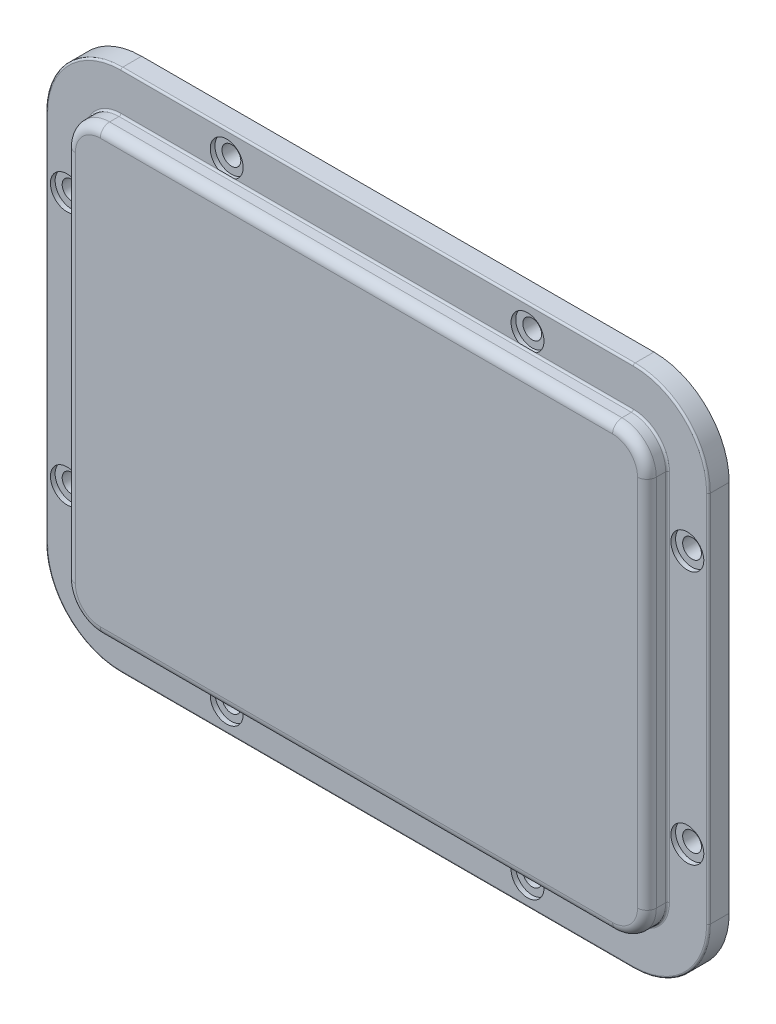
ISO-10303-21;
HEADER;
FILE_DESCRIPTION(('STEP AP214'),'2;1');
FILE_NAME('part.step','',(''),(''),'','','');
FILE_SCHEMA(('AUTOMOTIVE_DESIGN { 1 0 10303 214 1 1 1 1 }'));
ENDSEC;
DATA;
#1=APPLICATION_CONTEXT('core data for automotive mechanical design processes');
#2=APPLICATION_PROTOCOL_DEFINITION('international standard','automotive_design',2000,#1);
#3=PRODUCT_CONTEXT('',#1,'mechanical');
#4=PRODUCT('Part','Part','',(#3));
#5=PRODUCT_RELATED_PRODUCT_CATEGORY('part','',(#4));
#6=PRODUCT_DEFINITION_FORMATION('','',#4);
#7=PRODUCT_DEFINITION_CONTEXT('part definition',#1,'design');
#8=PRODUCT_DEFINITION('design','',#6,#7);
#9=PRODUCT_DEFINITION_SHAPE('','',#8);
#10=(LENGTH_UNIT() NAMED_UNIT(*) SI_UNIT(.MILLI.,.METRE.));
#11=(NAMED_UNIT(*) PLANE_ANGLE_UNIT() SI_UNIT($,.RADIAN.));
#12=(NAMED_UNIT(*) SI_UNIT($,.STERADIAN.) SOLID_ANGLE_UNIT());
#13=UNCERTAINTY_MEASURE_WITH_UNIT(LENGTH_MEASURE(1.E-05),#10,'distance_accuracy_value','');
#14=(GEOMETRIC_REPRESENTATION_CONTEXT(3) GLOBAL_UNCERTAINTY_ASSIGNED_CONTEXT((#13)) GLOBAL_UNIT_ASSIGNED_CONTEXT((#10,
#11,#12)) REPRESENTATION_CONTEXT('',''));
#15=CARTESIAN_POINT('',(0.,0.,0.));
#16=DIRECTION('',(0.,0.,1.));
#17=DIRECTION('',(1.,0.,0.));
#18=AXIS2_PLACEMENT_3D('',#15,#16,#17);
#19=CARTESIAN_POINT('',(-33.,13.5,-0.00100000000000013));
#20=DIRECTION('',(0.,0.,1.));
#21=DIRECTION('',(1.,0.,0.));
#22=AXIS2_PLACEMENT_3D('',#19,#20,#21);
#23=CYLINDRICAL_SURFACE('',#22,0.999999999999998);
#24=CARTESIAN_POINT('',(-33.,13.5,2.2));
#25=DIRECTION('',(0.,0.,-1.));
#26=DIRECTION('',(-1.,0.,0.));
#27=AXIS2_PLACEMENT_3D('',#24,#25,#26);
#28=CIRCLE('',#27,0.999999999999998);
#29=CARTESIAN_POINT('',(-34.,13.5,2.2));
#30=VERTEX_POINT('',#29);
#31=EDGE_CURVE('E782',#30,#30,#28,.F.);
#32=ORIENTED_EDGE('',*,*,#31,.F.);
#33=EDGE_LOOP('',(#32));
#34=FACE_BOUND('',#33,.T.);
#35=CARTESIAN_POINT('',(-33.,13.5,3.9));
#36=DIRECTION('',(0.,0.,1.));
#37=DIRECTION('',(1.,0.,0.));
#38=AXIS2_PLACEMENT_3D('',#35,#36,#37);
#39=CIRCLE('',#38,0.999999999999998);
#40=CARTESIAN_POINT('',(-32.,13.5,3.9));
#41=VERTEX_POINT('',#40);
#42=EDGE_CURVE('E41',#41,#41,#39,.F.);
#43=ORIENTED_EDGE('',*,*,#42,.F.);
#44=EDGE_LOOP('',(#43));
#45=FACE_BOUND('',#44,.T.);
#46=ADVANCED_FACE('F37',(#34,#45),#23,.F.);
#47=CARTESIAN_POINT('',(-16.,25.2,-0.00100000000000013));
#48=DIRECTION('',(0.,0.,1.));
#49=DIRECTION('',(1.,0.,0.));
#50=AXIS2_PLACEMENT_3D('',#47,#48,#49);
#51=CYLINDRICAL_SURFACE('',#50,1.);
#52=CARTESIAN_POINT('',(-16.,25.2,2.2));
#53=DIRECTION('',(0.,0.,-1.));
#54=DIRECTION('',(-1.,0.,0.));
#55=AXIS2_PLACEMENT_3D('',#52,#53,#54);
#56=CIRCLE('',#55,1.);
#57=CARTESIAN_POINT('',(-17.,25.2,2.2));
#58=VERTEX_POINT('',#57);
#59=EDGE_CURVE('E785',#58,#58,#56,.F.);
#60=ORIENTED_EDGE('',*,*,#59,.F.);
#61=EDGE_LOOP('',(#60));
#62=FACE_BOUND('',#61,.T.);
#63=CARTESIAN_POINT('',(-16.,25.2,3.9));
#64=DIRECTION('',(0.,0.,1.));
#65=DIRECTION('',(1.,0.,0.));
#66=AXIS2_PLACEMENT_3D('',#63,#64,#65);
#67=CIRCLE('',#66,1.);
#68=CARTESIAN_POINT('',(-15.,25.2,3.9));
#69=VERTEX_POINT('',#68);
#70=EDGE_CURVE('E781',#69,#69,#67,.F.);
#71=ORIENTED_EDGE('',*,*,#70,.F.);
#72=EDGE_LOOP('',(#71));
#73=FACE_BOUND('',#72,.T.);
#74=ADVANCED_FACE('F914',(#62,#73),#51,.F.);
#75=CARTESIAN_POINT('',(-35.25,0.,6.6));
#76=DIRECTION('',(1.,0.,0.));
#77=DIRECTION('',(0.,1.,0.));
#78=AXIS2_PLACEMENT_3D('',#75,#76,#77);
#79=PLANE('',#78);
#80=DIRECTION('',(0.,1.,0.));
#81=VECTOR('',#80,1.);
#82=CARTESIAN_POINT('',(-35.25,0.,2.2));
#83=LINE('',#82,#81);
#84=CARTESIAN_POINT('',(-35.25,-19.85,2.2));
#85=VERTEX_POINT('',#84);
#86=CARTESIAN_POINT('',(-35.25,19.85,2.2));
#87=VERTEX_POINT('',#86);
#88=EDGE_CURVE('E824',#85,#87,#83,.T.);
#89=ORIENTED_EDGE('',*,*,#88,.F.);
#90=DIRECTION('',(0.,0.,-1.));
#91=VECTOR('',#90,1.);
#92=CARTESIAN_POINT('',(-35.25,-19.85,6.6));
#93=LINE('',#92,#91);
#94=CARTESIAN_POINT('',(-35.25,-19.85,4.2));
#95=VERTEX_POINT('',#94);
#96=EDGE_CURVE('E572',#95,#85,#93,.T.);
#97=ORIENTED_EDGE('',*,*,#96,.F.);
#98=DIRECTION('',(0.,-1.,0.));
#99=VECTOR('',#98,1.);
#100=CARTESIAN_POINT('',(-35.25,19.85,4.2));
#101=LINE('',#100,#99);
#102=CARTESIAN_POINT('',(-35.25,19.85,4.2));
#103=VERTEX_POINT('',#102);
#104=EDGE_CURVE('E880',#95,#103,#101,.F.);
#105=ORIENTED_EDGE('',*,*,#104,.T.);
#106=DIRECTION('',(0.,0.,-1.));
#107=VECTOR('',#106,1.);
#108=CARTESIAN_POINT('',(-35.25,19.85,6.6));
#109=LINE('',#108,#107);
#110=EDGE_CURVE('E854',#103,#87,#109,.T.);
#111=ORIENTED_EDGE('',*,*,#110,.T.);
#112=EDGE_LOOP('',(#89,#97,#105,#111));
#113=FACE_BOUND('',#112,.T.);
#114=ADVANCED_FACE('F39',(#113),#79,.F.);
#115=CARTESIAN_POINT('',(-27.25,27.85,6.6));
#116=DIRECTION('',(0.,-1.,0.));
#117=DIRECTION('',(0.,0.,-1.));
#118=AXIS2_PLACEMENT_3D('',#115,#116,#117);
#119=PLANE('',#118);
#120=DIRECTION('',(1.,0.,0.));
#121=VECTOR('',#120,1.);
#122=CARTESIAN_POINT('',(-27.25,27.85,2.2));
#123=LINE('',#122,#121);
#124=CARTESIAN_POINT('',(-27.25,27.85,2.2));
#125=VERTEX_POINT('',#124);
#126=CARTESIAN_POINT('',(27.25,27.85,2.2));
#127=VERTEX_POINT('',#126);
#128=EDGE_CURVE('E830',#125,#127,#123,.T.);
#129=ORIENTED_EDGE('',*,*,#128,.F.);
#130=DIRECTION('',(0.,0.,-1.));
#131=VECTOR('',#130,1.);
#132=CARTESIAN_POINT('',(-27.25,27.85,6.6));
#133=LINE('',#132,#131);
#134=CARTESIAN_POINT('',(-27.25,27.85,4.2));
#135=VERTEX_POINT('',#134);
#136=EDGE_CURVE('E859',#135,#125,#133,.T.);
#137=ORIENTED_EDGE('',*,*,#136,.F.);
#138=DIRECTION('',(-1.,0.,0.));
#139=VECTOR('',#138,1.);
#140=CARTESIAN_POINT('',(0.,27.85,4.2));
#141=LINE('',#140,#139);
#142=CARTESIAN_POINT('',(27.25,27.85,4.2));
#143=VERTEX_POINT('',#142);
#144=EDGE_CURVE('E886',#135,#143,#141,.F.);
#145=ORIENTED_EDGE('',*,*,#144,.T.);
#146=DIRECTION('',(0.,0.,-1.));
#147=VECTOR('',#146,1.);
#148=CARTESIAN_POINT('',(27.25,27.85,6.6));
#149=LINE('',#148,#147);
#150=EDGE_CURVE('E713',#143,#127,#149,.T.);
#151=ORIENTED_EDGE('',*,*,#150,.T.);
#152=EDGE_LOOP('',(#129,#137,#145,#151));
#153=FACE_BOUND('',#152,.T.);
#154=ADVANCED_FACE('F922',(#153),#119,.F.);
#155=CARTESIAN_POINT('',(-27.25,19.85,6.6));
#156=DIRECTION('',(0.,0.,-1.));
#157=DIRECTION('',(-1.,0.,0.));
#158=AXIS2_PLACEMENT_3D('',#155,#156,#157);
#159=CYLINDRICAL_SURFACE('',#158,8.);
#160=CARTESIAN_POINT('',(-27.25,19.85,2.2));
#161=DIRECTION('',(0.,0.,-1.));
#162=DIRECTION('',(-1.,0.,0.));
#163=AXIS2_PLACEMENT_3D('',#160,#161,#162);
#164=CIRCLE('',#163,8.);
#165=EDGE_CURVE('E828',#87,#125,#164,.T.);
#166=ORIENTED_EDGE('',*,*,#165,.F.);
#167=ORIENTED_EDGE('',*,*,#110,.F.);
#168=CARTESIAN_POINT('',(-27.25,19.85,4.2));
#169=DIRECTION('',(0.,0.,1.));
#170=DIRECTION('',(1.,0.,0.));
#171=AXIS2_PLACEMENT_3D('',#168,#169,#170);
#172=CIRCLE('',#171,8.);
#173=EDGE_CURVE('E882',#103,#135,#172,.F.);
#174=ORIENTED_EDGE('',*,*,#173,.T.);
#175=ORIENTED_EDGE('',*,*,#136,.T.);
#176=EDGE_LOOP('',(#166,#167,#174,#175));
#177=FACE_BOUND('',#176,.T.);
#178=ADVANCED_FACE('F1026',(#177),#159,.T.);
#179=CARTESIAN_POINT('',(-27.25,19.85,0.));
#180=DIRECTION('',(0.,0.,-1.));
#181=DIRECTION('',(-1.,0.,0.));
#182=AXIS2_PLACEMENT_3D('',#179,#180,#181);
#183=PLANE('',#182);
#184=DIRECTION('',(0.,1.,0.));
#185=VECTOR('',#184,1.);
#186=CARTESIAN_POINT('',(-28.7,0.,0.));
#187=LINE('',#186,#185);
#188=CARTESIAN_POINT('',(-28.7,-20.6,0.));
#189=VERTEX_POINT('',#188);
#190=CARTESIAN_POINT('',(-28.7,20.6,0.));
#191=VERTEX_POINT('',#190);
#192=EDGE_CURVE('E793',#189,#191,#187,.T.);
#193=ORIENTED_EDGE('',*,*,#192,.F.);
#194=CARTESIAN_POINT('',(-27.9,-20.6,0.));
#195=DIRECTION('',(0.,0.,1.));
#196=DIRECTION('',(1.,0.,0.));
#197=AXIS2_PLACEMENT_3D('',#194,#195,#196);
#198=CIRCLE('',#197,0.799999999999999);
#199=CARTESIAN_POINT('',(-27.9,-21.4,0.));
#200=VERTEX_POINT('',#199);
#201=EDGE_CURVE('E520',#189,#200,#198,.T.);
#202=ORIENTED_EDGE('',*,*,#201,.T.);
#203=DIRECTION('',(1.,0.,0.));
#204=VECTOR('',#203,1.);
#205=CARTESIAN_POINT('',(0.0375349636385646,-21.4,0.));
#206=LINE('',#205,#204);
#207=CARTESIAN_POINT('',(27.9,-21.4,0.));
#208=VERTEX_POINT('',#207);
#209=EDGE_CURVE('E523',#200,#208,#206,.T.);
#210=ORIENTED_EDGE('',*,*,#209,.T.);
#211=CARTESIAN_POINT('',(27.9,-20.6,0.));
#212=DIRECTION('',(0.,0.,-1.));
#213=DIRECTION('',(-1.,0.,0.));
#214=AXIS2_PLACEMENT_3D('',#211,#212,#213);
#215=CIRCLE('',#214,0.799999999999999);
#216=CARTESIAN_POINT('',(28.7,-20.6,0.));
#217=VERTEX_POINT('',#216);
#218=EDGE_CURVE('E420',#217,#208,#215,.T.);
#219=ORIENTED_EDGE('',*,*,#218,.F.);
#220=DIRECTION('',(0.,1.,0.));
#221=VECTOR('',#220,1.);
#222=CARTESIAN_POINT('',(28.7,0.,0.));
#223=LINE('',#222,#221);
#224=CARTESIAN_POINT('',(28.7,20.6,0.));
#225=VERTEX_POINT('',#224);
#226=EDGE_CURVE('E656',#217,#225,#223,.T.);
#227=ORIENTED_EDGE('',*,*,#226,.T.);
#228=CARTESIAN_POINT('',(27.9,20.6,0.));
#229=DIRECTION('',(0.,0.,1.));
#230=DIRECTION('',(-1.,0.,0.));
#231=AXIS2_PLACEMENT_3D('',#228,#229,#230);
#232=CIRCLE('',#231,0.799999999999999);
#233=CARTESIAN_POINT('',(27.9,21.4,0.));
#234=VERTEX_POINT('',#233);
#235=EDGE_CURVE('E659',#225,#234,#232,.T.);
#236=ORIENTED_EDGE('',*,*,#235,.T.);
#237=DIRECTION('',(1.,0.,0.));
#238=VECTOR('',#237,1.);
#239=CARTESIAN_POINT('',(0.0375349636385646,21.4,0.));
#240=LINE('',#239,#238);
#241=CARTESIAN_POINT('',(-27.9,21.4,0.));
#242=VERTEX_POINT('',#241);
#243=EDGE_CURVE('E799',#242,#234,#240,.T.);
#244=ORIENTED_EDGE('',*,*,#243,.F.);
#245=CARTESIAN_POINT('',(-27.9,20.6,0.));
#246=DIRECTION('',(0.,0.,-1.));
#247=DIRECTION('',(1.,0.,0.));
#248=AXIS2_PLACEMENT_3D('',#245,#246,#247);
#249=CIRCLE('',#248,0.799999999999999);
#250=EDGE_CURVE('E796',#191,#242,#249,.T.);
#251=ORIENTED_EDGE('',*,*,#250,.F.);
#252=EDGE_LOOP('',(#193,#202,#210,#219,#227,#236,#244,#251));
#253=FACE_BOUND('',#252,.T.);
#254=CARTESIAN_POINT('',(-27.9,-20.6,0.));
#255=DIRECTION('',(0.,0.,1.));
#256=DIRECTION('',(1.,0.,0.));
#257=AXIS2_PLACEMENT_3D('',#254,#255,#256);
#258=CIRCLE('',#257,2.);
#259=CARTESIAN_POINT('',(-29.9,-20.6,0.));
#260=VERTEX_POINT('',#259);
#261=CARTESIAN_POINT('',(-27.9,-22.6,0.));
#262=VERTEX_POINT('',#261);
#263=EDGE_CURVE('E529',#260,#262,#258,.T.);
#264=ORIENTED_EDGE('',*,*,#263,.F.);
#265=DIRECTION('',(0.,1.,0.));
#266=VECTOR('',#265,1.);
#267=CARTESIAN_POINT('',(-29.9,0.,0.));
#268=LINE('',#267,#266);
#269=CARTESIAN_POINT('',(-29.9,20.6,0.));
#270=VERTEX_POINT('',#269);
#271=EDGE_CURVE('E804',#260,#270,#268,.T.);
#272=ORIENTED_EDGE('',*,*,#271,.T.);
#273=CARTESIAN_POINT('',(-27.9,20.6,0.));
#274=DIRECTION('',(0.,0.,-1.));
#275=DIRECTION('',(1.,0.,0.));
#276=AXIS2_PLACEMENT_3D('',#273,#274,#275);
#277=CIRCLE('',#276,2.);
#278=CARTESIAN_POINT('',(-27.9,22.6,0.));
#279=VERTEX_POINT('',#278);
#280=EDGE_CURVE('E808',#270,#279,#277,.T.);
#281=ORIENTED_EDGE('',*,*,#280,.T.);
#282=DIRECTION('',(1.,0.,0.));
#283=VECTOR('',#282,1.);
#284=CARTESIAN_POINT('',(0.,22.6,0.));
#285=LINE('',#284,#283);
#286=CARTESIAN_POINT('',(27.9,22.6,0.));
#287=VERTEX_POINT('',#286);
#288=EDGE_CURVE('E811',#279,#287,#285,.T.);
#289=ORIENTED_EDGE('',*,*,#288,.T.);
#290=CARTESIAN_POINT('',(27.9,20.6,0.));
#291=DIRECTION('',(0.,0.,1.));
#292=DIRECTION('',(-1.,0.,0.));
#293=AXIS2_PLACEMENT_3D('',#290,#291,#292);
#294=CIRCLE('',#293,2.);
#295=CARTESIAN_POINT('',(29.9,20.6,0.));
#296=VERTEX_POINT('',#295);
#297=EDGE_CURVE('E670',#296,#287,#294,.T.);
#298=ORIENTED_EDGE('',*,*,#297,.F.);
#299=DIRECTION('',(0.,1.,0.));
#300=VECTOR('',#299,1.);
#301=CARTESIAN_POINT('',(29.9,0.,0.));
#302=LINE('',#301,#300);
#303=CARTESIAN_POINT('',(29.9,-20.6,0.));
#304=VERTEX_POINT('',#303);
#305=EDGE_CURVE('E666',#304,#296,#302,.T.);
#306=ORIENTED_EDGE('',*,*,#305,.F.);
#307=CARTESIAN_POINT('',(27.9,-20.6,0.));
#308=DIRECTION('',(0.,0.,-1.));
#309=DIRECTION('',(-1.,0.,0.));
#310=AXIS2_PLACEMENT_3D('',#307,#308,#309);
#311=CIRCLE('',#310,2.);
#312=CARTESIAN_POINT('',(27.9,-22.6,0.));
#313=VERTEX_POINT('',#312);
#314=EDGE_CURVE('E426',#304,#313,#311,.T.);
#315=ORIENTED_EDGE('',*,*,#314,.T.);
#316=DIRECTION('',(1.,0.,0.));
#317=VECTOR('',#316,1.);
#318=CARTESIAN_POINT('',(0.,-22.6,0.));
#319=LINE('',#318,#317);
#320=EDGE_CURVE('E534',#262,#313,#319,.T.);
#321=ORIENTED_EDGE('',*,*,#320,.F.);
#322=EDGE_LOOP('',(#264,#272,#281,#289,#298,#306,#315,#321));
#323=FACE_BOUND('',#322,.T.);
#324=ADVANCED_FACE('F1023',(#253,#323),#183,.T.);
#325=CARTESIAN_POINT('',(-27.25,19.85,6.6));
#326=DIRECTION('',(0.,0.,-1.));
#327=DIRECTION('',(-1.,0.,0.));
#328=AXIS2_PLACEMENT_3D('',#325,#326,#327);
#329=PLANE('',#328);
#330=CARTESIAN_POINT('',(-27.25,19.85,6.6));
#331=DIRECTION('',(0.,0.,-1.));
#332=DIRECTION('',(-1.,0.,0.));
#333=AXIS2_PLACEMENT_3D('',#330,#331,#332);
#334=CIRCLE('',#333,2.65);
#335=CARTESIAN_POINT('',(-27.25,22.5,6.6));
#336=VERTEX_POINT('',#335);
#337=CARTESIAN_POINT('',(-29.9,19.85,6.6));
#338=VERTEX_POINT('',#337);
#339=EDGE_CURVE('E890',#336,#338,#334,.F.);
#340=ORIENTED_EDGE('',*,*,#339,.T.);
#341=DIRECTION('',(0.,-1.,0.));
#342=VECTOR('',#341,1.);
#343=CARTESIAN_POINT('',(-29.9,0.,6.6));
#344=LINE('',#343,#342);
#345=CARTESIAN_POINT('',(-29.9,-19.85,6.6));
#346=VERTEX_POINT('',#345);
#347=EDGE_CURVE('E892',#338,#346,#344,.T.);
#348=ORIENTED_EDGE('',*,*,#347,.T.);
#349=CARTESIAN_POINT('',(-27.25,-19.85,6.6));
#350=DIRECTION('',(0.,0.,1.));
#351=DIRECTION('',(-1.,0.,0.));
#352=AXIS2_PLACEMENT_3D('',#349,#350,#351);
#353=CIRCLE('',#352,2.65);
#354=CARTESIAN_POINT('',(-27.25,-22.5,6.6));
#355=VERTEX_POINT('',#354);
#356=EDGE_CURVE('E602',#355,#346,#353,.F.);
#357=ORIENTED_EDGE('',*,*,#356,.F.);
#358=DIRECTION('',(-1.,0.,0.));
#359=VECTOR('',#358,1.);
#360=CARTESIAN_POINT('',(-27.25,-22.5,6.6));
#361=LINE('',#360,#359);
#362=CARTESIAN_POINT('',(27.25,-22.5,6.6));
#363=VERTEX_POINT('',#362);
#364=EDGE_CURVE('E599',#363,#355,#361,.T.);
#365=ORIENTED_EDGE('',*,*,#364,.F.);
#366=CARTESIAN_POINT('',(27.25,-19.85,6.6));
#367=DIRECTION('',(0.,0.,-1.));
#368=DIRECTION('',(1.,0.,0.));
#369=AXIS2_PLACEMENT_3D('',#366,#367,#368);
#370=CIRCLE('',#369,2.65);
#371=CARTESIAN_POINT('',(29.9,-19.85,6.6));
#372=VERTEX_POINT('',#371);
#373=EDGE_CURVE('E481',#363,#372,#370,.F.);
#374=ORIENTED_EDGE('',*,*,#373,.T.);
#375=DIRECTION('',(0.,-1.,0.));
#376=VECTOR('',#375,1.);
#377=CARTESIAN_POINT('',(29.9,0.,6.6));
#378=LINE('',#377,#376);
#379=CARTESIAN_POINT('',(29.9,19.85,6.6));
#380=VERTEX_POINT('',#379);
#381=EDGE_CURVE('E744',#380,#372,#378,.T.);
#382=ORIENTED_EDGE('',*,*,#381,.F.);
#383=CARTESIAN_POINT('',(27.25,19.85,6.6));
#384=DIRECTION('',(0.,0.,1.));
#385=DIRECTION('',(1.,0.,0.));
#386=AXIS2_PLACEMENT_3D('',#383,#384,#385);
#387=CIRCLE('',#386,2.65);
#388=CARTESIAN_POINT('',(27.25,22.5,6.6));
#389=VERTEX_POINT('',#388);
#390=EDGE_CURVE('E741',#389,#380,#387,.F.);
#391=ORIENTED_EDGE('',*,*,#390,.F.);
#392=DIRECTION('',(-1.,0.,0.));
#393=VECTOR('',#392,1.);
#394=CARTESIAN_POINT('',(-27.25,22.5,6.6));
#395=LINE('',#394,#393);
#396=EDGE_CURVE('E888',#389,#336,#395,.T.);
#397=ORIENTED_EDGE('',*,*,#396,.T.);
#398=EDGE_LOOP('',(#340,#348,#357,#365,#374,#382,#391,#397));
#399=FACE_BOUND('',#398,.T.);
#400=ADVANCED_FACE('F1022',(#399),#329,.F.);
#401=CARTESIAN_POINT('',(-17.625,13.925,4.4));
#402=DIRECTION('',(0.,0.,1.));
#403=DIRECTION('',(1.,0.,0.));
#404=AXIS2_PLACEMENT_3D('',#401,#402,#403);
#405=PLANE('',#404);
#406=DIRECTION('',(0.,-1.,0.));
#407=VECTOR('',#406,1.);
#408=CARTESIAN_POINT('',(31.1,19.85,4.4));
#409=LINE('',#408,#407);
#410=CARTESIAN_POINT('',(31.1,-19.85,4.4));
#411=VERTEX_POINT('',#410);
#412=CARTESIAN_POINT('',(31.1,19.85,4.4));
#413=VERTEX_POINT('',#412);
#414=EDGE_CURVE('E729',#411,#413,#409,.F.);
#415=ORIENTED_EDGE('',*,*,#414,.F.);
#416=CARTESIAN_POINT('',(27.25,-19.85,4.4));
#417=DIRECTION('',(0.,0.,1.));
#418=DIRECTION('',(-1.,0.,0.));
#419=AXIS2_PLACEMENT_3D('',#416,#417,#418);
#420=CIRCLE('',#419,3.85);
#421=CARTESIAN_POINT('',(27.25,-23.7,4.4));
#422=VERTEX_POINT('',#421);
#423=EDGE_CURVE('E474',#411,#422,#420,.F.);
#424=ORIENTED_EDGE('',*,*,#423,.T.);
#425=DIRECTION('',(1.,0.,0.));
#426=VECTOR('',#425,1.);
#427=CARTESIAN_POINT('',(0.,-23.7,4.4));
#428=LINE('',#427,#426);
#429=CARTESIAN_POINT('',(16.901387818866,-23.7,4.4));
#430=VERTEX_POINT('',#429);
#431=EDGE_CURVE('E399',#422,#430,#428,.F.);
#432=ORIENTED_EDGE('',*,*,#431,.T.);
#433=CARTESIAN_POINT('',(16.,-25.2,4.4));
#434=DIRECTION('',(0.,0.,1.));
#435=DIRECTION('',(-1.,0.,0.));
#436=AXIS2_PLACEMENT_3D('',#433,#434,#435);
#437=CIRCLE('',#436,1.75);
#438=CARTESIAN_POINT('',(15.098612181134,-23.7,4.4));
#439=VERTEX_POINT('',#438);
#440=EDGE_CURVE('E369',#439,#430,#437,.T.);
#441=ORIENTED_EDGE('',*,*,#440,.F.);
#442=DIRECTION('',(-1.,0.,0.));
#443=VECTOR('',#442,1.);
#444=CARTESIAN_POINT('',(0.,-23.7,4.4));
#445=LINE('',#444,#443);
#446=CARTESIAN_POINT('',(-15.098612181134,-23.7,4.4));
#447=VERTEX_POINT('',#446);
#448=EDGE_CURVE('E384',#447,#439,#445,.F.);
#449=ORIENTED_EDGE('',*,*,#448,.F.);
#450=CARTESIAN_POINT('',(-16.,-25.2,4.4));
#451=DIRECTION('',(0.,0.,-1.));
#452=DIRECTION('',(1.,0.,0.));
#453=AXIS2_PLACEMENT_3D('',#450,#451,#452);
#454=CIRCLE('',#453,1.75);
#455=CARTESIAN_POINT('',(-16.901387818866,-23.7,4.4));
#456=VERTEX_POINT('',#455);
#457=EDGE_CURVE('E504',#447,#456,#454,.T.);
#458=ORIENTED_EDGE('',*,*,#457,.T.);
#459=CARTESIAN_POINT('',(-27.25,-23.7,4.4));
#460=VERTEX_POINT('',#459);
#461=EDGE_CURVE('E393',#460,#456,#445,.F.);
#462=ORIENTED_EDGE('',*,*,#461,.F.);
#463=CARTESIAN_POINT('',(-27.25,-19.85,4.4));
#464=DIRECTION('',(0.,0.,-1.));
#465=DIRECTION('',(1.,0.,0.));
#466=AXIS2_PLACEMENT_3D('',#463,#464,#465);
#467=CIRCLE('',#466,3.85);
#468=CARTESIAN_POINT('',(-31.1,-19.85,4.4));
#469=VERTEX_POINT('',#468);
#470=EDGE_CURVE('E585',#469,#460,#467,.F.);
#471=ORIENTED_EDGE('',*,*,#470,.F.);
#472=DIRECTION('',(0.,-1.,0.));
#473=VECTOR('',#472,1.);
#474=CARTESIAN_POINT('',(-31.1,19.85,4.4));
#475=LINE('',#474,#473);
#476=CARTESIAN_POINT('',(-31.1,19.85,4.4));
#477=VERTEX_POINT('',#476);
#478=EDGE_CURVE('E876',#469,#477,#475,.F.);
#479=ORIENTED_EDGE('',*,*,#478,.T.);
#480=CARTESIAN_POINT('',(-27.25,19.85,4.4));
#481=DIRECTION('',(0.,0.,1.));
#482=DIRECTION('',(1.,0.,0.));
#483=AXIS2_PLACEMENT_3D('',#480,#481,#482);
#484=CIRCLE('',#483,3.85);
#485=CARTESIAN_POINT('',(-27.25,23.7,4.4));
#486=VERTEX_POINT('',#485);
#487=EDGE_CURVE('E874',#477,#486,#484,.F.);
#488=ORIENTED_EDGE('',*,*,#487,.T.);
#489=DIRECTION('',(-1.,0.,0.));
#490=VECTOR('',#489,1.);
#491=CARTESIAN_POINT('',(0.,23.7,4.4));
#492=LINE('',#491,#490);
#493=CARTESIAN_POINT('',(-16.901387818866,23.7,4.4));
#494=VERTEX_POINT('',#493);
#495=EDGE_CURVE('E871',#486,#494,#492,.F.);
#496=ORIENTED_EDGE('',*,*,#495,.T.);
#497=CARTESIAN_POINT('',(-16.,25.2,4.4));
#498=DIRECTION('',(0.,0.,1.));
#499=DIRECTION('',(1.,0.,0.));
#500=AXIS2_PLACEMENT_3D('',#497,#498,#499);
#501=CIRCLE('',#500,1.75);
#502=CARTESIAN_POINT('',(-15.098612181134,23.7,4.4));
#503=VERTEX_POINT('',#502);
#504=EDGE_CURVE('E775',#503,#494,#501,.T.);
#505=ORIENTED_EDGE('',*,*,#504,.F.);
#506=CARTESIAN_POINT('',(15.098612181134,23.7,4.4));
#507=VERTEX_POINT('',#506);
#508=EDGE_CURVE('E870',#503,#507,#492,.F.);
#509=ORIENTED_EDGE('',*,*,#508,.T.);
#510=CARTESIAN_POINT('',(16.,25.2,4.4));
#511=DIRECTION('',(0.,0.,-1.));
#512=DIRECTION('',(-1.,0.,0.));
#513=AXIS2_PLACEMENT_3D('',#510,#511,#512);
#514=CIRCLE('',#513,1.75);
#515=CARTESIAN_POINT('',(16.901387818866,23.7,4.4));
#516=VERTEX_POINT('',#515);
#517=EDGE_CURVE('E638',#507,#516,#514,.T.);
#518=ORIENTED_EDGE('',*,*,#517,.T.);
#519=DIRECTION('',(1.,0.,0.));
#520=VECTOR('',#519,1.);
#521=CARTESIAN_POINT('',(0.,23.7,4.4));
#522=LINE('',#521,#520);
#523=CARTESIAN_POINT('',(27.25,23.7,4.4));
#524=VERTEX_POINT('',#523);
#525=EDGE_CURVE('E723',#524,#516,#522,.F.);
#526=ORIENTED_EDGE('',*,*,#525,.F.);
#527=CARTESIAN_POINT('',(27.25,19.85,4.4));
#528=DIRECTION('',(0.,0.,-1.));
#529=DIRECTION('',(-1.,0.,0.));
#530=AXIS2_PLACEMENT_3D('',#527,#528,#529);
#531=CIRCLE('',#530,3.85);
#532=EDGE_CURVE('E726',#413,#524,#531,.F.);
#533=ORIENTED_EDGE('',*,*,#532,.F.);
#534=EDGE_LOOP('',(#415,#424,#432,#441,#449,#458,#462,#471,#479,#488,#496,#505,#509,#518,#526,#533));
#535=FACE_BOUND('',#534,.T.);
#536=CARTESIAN_POINT('',(-33.,13.5,4.4));
#537=DIRECTION('',(0.,0.,1.));
#538=DIRECTION('',(1.,0.,0.));
#539=AXIS2_PLACEMENT_3D('',#536,#537,#538);
#540=CIRCLE('',#539,1.75);
#541=CARTESIAN_POINT('',(-31.25,13.5,4.4));
#542=VERTEX_POINT('',#541);
#543=EDGE_CURVE('E763',#542,#542,#540,.T.);
#544=ORIENTED_EDGE('',*,*,#543,.F.);
#545=EDGE_LOOP('',(#544));
#546=FACE_BOUND('',#545,.T.);
#547=CARTESIAN_POINT('',(27.25,-19.85,4.4));
#548=DIRECTION('',(0.,0.,1.));
#549=DIRECTION('',(-1.,0.,0.));
#550=AXIS2_PLACEMENT_3D('',#547,#548,#549);
#551=CIRCLE('',#550,7.8);
#552=CARTESIAN_POINT('',(27.25,-27.65,4.4));
#553=VERTEX_POINT('',#552);
#554=CARTESIAN_POINT('',(35.05,-19.85,4.4));
#555=VERTEX_POINT('',#554);
#556=EDGE_CURVE('E470',#553,#555,#551,.T.);
#557=ORIENTED_EDGE('',*,*,#556,.T.);
#558=DIRECTION('',(0.,-1.,0.));
#559=VECTOR('',#558,1.);
#560=CARTESIAN_POINT('',(35.05,0.,4.4));
#561=LINE('',#560,#559);
#562=CARTESIAN_POINT('',(35.05,19.85,4.4));
#563=VERTEX_POINT('',#562);
#564=EDGE_CURVE('E721',#563,#555,#561,.T.);
#565=ORIENTED_EDGE('',*,*,#564,.F.);
#566=CARTESIAN_POINT('',(27.25,19.85,4.4));
#567=DIRECTION('',(0.,0.,-1.));
#568=DIRECTION('',(-1.,0.,0.));
#569=AXIS2_PLACEMENT_3D('',#566,#567,#568);
#570=CIRCLE('',#569,7.8);
#571=CARTESIAN_POINT('',(27.25,27.65,4.4));
#572=VERTEX_POINT('',#571);
#573=EDGE_CURVE('E718',#572,#563,#570,.T.);
#574=ORIENTED_EDGE('',*,*,#573,.F.);
#575=DIRECTION('',(-1.,0.,0.));
#576=VECTOR('',#575,1.);
#577=CARTESIAN_POINT('',(-27.25,27.65,4.4));
#578=LINE('',#577,#576);
#579=CARTESIAN_POINT('',(-27.25,27.65,4.4));
#580=VERTEX_POINT('',#579);
#581=EDGE_CURVE('E864',#572,#580,#578,.T.);
#582=ORIENTED_EDGE('',*,*,#581,.T.);
#583=CARTESIAN_POINT('',(-27.25,19.85,4.4));
#584=DIRECTION('',(0.,0.,1.));
#585=DIRECTION('',(1.,0.,0.));
#586=AXIS2_PLACEMENT_3D('',#583,#584,#585);
#587=CIRCLE('',#586,7.8);
#588=CARTESIAN_POINT('',(-35.05,19.85,4.4));
#589=VERTEX_POINT('',#588);
#590=EDGE_CURVE('E866',#580,#589,#587,.T.);
#591=ORIENTED_EDGE('',*,*,#590,.T.);
#592=DIRECTION('',(0.,-1.,0.));
#593=VECTOR('',#592,1.);
#594=CARTESIAN_POINT('',(-35.05,0.,4.4));
#595=LINE('',#594,#593);
#596=CARTESIAN_POINT('',(-35.05,-19.85,4.4));
#597=VERTEX_POINT('',#596);
#598=EDGE_CURVE('E868',#589,#597,#595,.T.);
#599=ORIENTED_EDGE('',*,*,#598,.T.);
#600=CARTESIAN_POINT('',(-27.25,-19.85,4.4));
#601=DIRECTION('',(0.,0.,-1.));
#602=DIRECTION('',(1.,0.,0.));
#603=AXIS2_PLACEMENT_3D('',#600,#601,#602);
#604=CIRCLE('',#603,7.8);
#605=CARTESIAN_POINT('',(-27.25,-27.65,4.4));
#606=VERTEX_POINT('',#605);
#607=EDGE_CURVE('E394',#606,#597,#604,.T.);
#608=ORIENTED_EDGE('',*,*,#607,.F.);
#609=DIRECTION('',(-1.,0.,0.));
#610=VECTOR('',#609,1.);
#611=CARTESIAN_POINT('',(-27.25,-27.65,4.4));
#612=LINE('',#611,#610);
#613=EDGE_CURVE('E580',#553,#606,#612,.T.);
#614=ORIENTED_EDGE('',*,*,#613,.F.);
#615=EDGE_LOOP('',(#557,#565,#574,#582,#591,#599,#608,#614));
#616=FACE_BOUND('',#615,.T.);
#617=CARTESIAN_POINT('',(33.,13.5,4.4));
#618=DIRECTION('',(0.,0.,-1.));
#619=DIRECTION('',(-1.,0.,0.));
#620=AXIS2_PLACEMENT_3D('',#617,#618,#619);
#621=CIRCLE('',#620,1.75);
#622=CARTESIAN_POINT('',(31.25,13.5,4.4));
#623=VERTEX_POINT('',#622);
#624=EDGE_CURVE('E623',#623,#623,#621,.T.);
#625=ORIENTED_EDGE('',*,*,#624,.T.);
#626=EDGE_LOOP('',(#625));
#627=FACE_BOUND('',#626,.T.);
#628=CARTESIAN_POINT('',(-33.,-13.5,4.4));
#629=DIRECTION('',(0.,0.,-1.));
#630=DIRECTION('',(1.,0.,0.));
#631=AXIS2_PLACEMENT_3D('',#628,#629,#630);
#632=CIRCLE('',#631,1.75);
#633=CARTESIAN_POINT('',(-31.25,-13.5,4.4));
#634=VERTEX_POINT('',#633);
#635=EDGE_CURVE('E492',#634,#634,#632,.T.);
#636=ORIENTED_EDGE('',*,*,#635,.T.);
#637=EDGE_LOOP('',(#636));
#638=FACE_BOUND('',#637,.T.);
#639=CARTESIAN_POINT('',(33.,-13.5,4.4));
#640=DIRECTION('',(0.,0.,1.));
#641=DIRECTION('',(-1.,0.,0.));
#642=AXIS2_PLACEMENT_3D('',#639,#640,#641);
#643=CIRCLE('',#642,1.75);
#644=CARTESIAN_POINT('',(31.25,-13.5,4.4));
#645=VERTEX_POINT('',#644);
#646=EDGE_CURVE('E1374',#645,#645,#643,.T.);
#647=ORIENTED_EDGE('',*,*,#646,.F.);
#648=EDGE_LOOP('',(#647));
#649=FACE_BOUND('',#648,.T.);
#650=ADVANCED_FACE('F396',(#535,#546,#616,#627,#638,#649),#405,.T.);
#651=CARTESIAN_POINT('',(-30.9,0.,4.4));
#652=DIRECTION('',(-1.,0.,0.));
#653=DIRECTION('',(0.,0.,1.));
#654=AXIS2_PLACEMENT_3D('',#651,#652,#653);
#655=PLANE('',#654);
#656=DIRECTION('',(0.,-1.,0.));
#657=VECTOR('',#656,1.);
#658=CARTESIAN_POINT('',(-30.9,0.,4.6));
#659=LINE('',#658,#657);
#660=CARTESIAN_POINT('',(-30.9,19.85,4.6));
#661=VERTEX_POINT('',#660);
#662=CARTESIAN_POINT('',(-30.9,-19.85,4.6));
#663=VERTEX_POINT('',#662);
#664=EDGE_CURVE('E862',#661,#663,#659,.T.);
#665=ORIENTED_EDGE('',*,*,#664,.T.);
#666=DIRECTION('',(0.,0.,1.));
#667=VECTOR('',#666,1.);
#668=CARTESIAN_POINT('',(-30.9,-19.85,4.4));
#669=LINE('',#668,#667);
#670=CARTESIAN_POINT('',(-30.9,-19.85,5.6));
#671=VERTEX_POINT('',#670);
#672=EDGE_CURVE('E569',#663,#671,#669,.T.);
#673=ORIENTED_EDGE('',*,*,#672,.T.);
#674=DIRECTION('',(0.,-1.,0.));
#675=VECTOR('',#674,1.);
#676=CARTESIAN_POINT('',(-30.9,19.85,5.6));
#677=LINE('',#676,#675);
#678=CARTESIAN_POINT('',(-30.9,19.85,5.6));
#679=VERTEX_POINT('',#678);
#680=EDGE_CURVE('E894',#671,#679,#677,.F.);
#681=ORIENTED_EDGE('',*,*,#680,.T.);
#682=DIRECTION('',(0.,0.,1.));
#683=VECTOR('',#682,1.);
#684=CARTESIAN_POINT('',(-30.9,19.85,4.4));
#685=LINE('',#684,#683);
#686=EDGE_CURVE('E851',#661,#679,#685,.T.);
#687=ORIENTED_EDGE('',*,*,#686,.F.);
#688=EDGE_LOOP('',(#665,#673,#681,#687));
#689=FACE_BOUND('',#688,.T.);
#690=ADVANCED_FACE('F1009',(#689),#655,.T.);
#691=CARTESIAN_POINT('',(-27.25,19.85,4.4));
#692=DIRECTION('',(0.,0.,1.));
#693=DIRECTION('',(1.,0.,0.));
#694=AXIS2_PLACEMENT_3D('',#691,#692,#693);
#695=CYLINDRICAL_SURFACE('',#694,3.65);
#696=ORIENTED_EDGE('',*,*,#686,.T.);
#697=CARTESIAN_POINT('',(-27.25,19.85,5.6));
#698=DIRECTION('',(0.,0.,-1.));
#699=DIRECTION('',(-1.,0.,0.));
#700=AXIS2_PLACEMENT_3D('',#697,#698,#699);
#701=CIRCLE('',#700,3.65);
#702=CARTESIAN_POINT('',(-27.25,23.5,5.6));
#703=VERTEX_POINT('',#702);
#704=EDGE_CURVE('E896',#679,#703,#701,.T.);
#705=ORIENTED_EDGE('',*,*,#704,.T.);
#706=DIRECTION('',(0.,0.,1.));
#707=VECTOR('',#706,1.);
#708=CARTESIAN_POINT('',(-27.25,23.5,4.4));
#709=LINE('',#708,#707);
#710=CARTESIAN_POINT('',(-27.25,23.5,4.6));
#711=VERTEX_POINT('',#710);
#712=EDGE_CURVE('E850',#711,#703,#709,.T.);
#713=ORIENTED_EDGE('',*,*,#712,.F.);
#714=CARTESIAN_POINT('',(-27.25,19.85,4.6));
#715=DIRECTION('',(0.,0.,1.));
#716=DIRECTION('',(1.,0.,0.));
#717=AXIS2_PLACEMENT_3D('',#714,#715,#716);
#718=CIRCLE('',#717,3.65);
#719=EDGE_CURVE('E878',#711,#661,#718,.T.);
#720=ORIENTED_EDGE('',*,*,#719,.T.);
#721=EDGE_LOOP('',(#696,#705,#713,#720));
#722=FACE_BOUND('',#721,.T.);
#723=ADVANCED_FACE('F1012',(#722),#695,.T.);
#724=CARTESIAN_POINT('',(0.,23.5,4.4));
#725=DIRECTION('',(0.,1.,0.));
#726=DIRECTION('',(-1.,0.,0.));
#727=AXIS2_PLACEMENT_3D('',#724,#725,#726);
#728=PLANE('',#727);
#729=ORIENTED_EDGE('',*,*,#712,.T.);
#730=DIRECTION('',(-1.,0.,0.));
#731=VECTOR('',#730,1.);
#732=CARTESIAN_POINT('',(0.,23.5,5.6));
#733=LINE('',#732,#731);
#734=CARTESIAN_POINT('',(27.25,23.5,5.6));
#735=VERTEX_POINT('',#734);
#736=EDGE_CURVE('E898',#703,#735,#733,.F.);
#737=ORIENTED_EDGE('',*,*,#736,.T.);
#738=DIRECTION('',(0.,0.,1.));
#739=VECTOR('',#738,1.);
#740=CARTESIAN_POINT('',(27.25,23.5,4.4));
#741=LINE('',#740,#739);
#742=CARTESIAN_POINT('',(27.25,23.5,4.6));
#743=VERTEX_POINT('',#742);
#744=EDGE_CURVE('E704',#743,#735,#741,.T.);
#745=ORIENTED_EDGE('',*,*,#744,.F.);
#746=DIRECTION('',(-1.,0.,0.));
#747=VECTOR('',#746,1.);
#748=CARTESIAN_POINT('',(-27.25,23.5,4.6));
#749=LINE('',#748,#747);
#750=EDGE_CURVE('E884',#743,#711,#749,.T.);
#751=ORIENTED_EDGE('',*,*,#750,.T.);
#752=EDGE_LOOP('',(#729,#737,#745,#751));
#753=FACE_BOUND('',#752,.T.);
#754=ADVANCED_FACE('F1007',(#753),#728,.T.);
#755=CARTESIAN_POINT('',(0.,23.7,4.6));
#756=DIRECTION('',(1.,0.,0.));
#757=DIRECTION('',(0.,1.,0.));
#758=AXIS2_PLACEMENT_3D('',#755,#756,#757);
#759=CYLINDRICAL_SURFACE('',#758,0.2);
#760=ORIENTED_EDGE('',*,*,#750,.F.);
#761=CARTESIAN_POINT('',(27.25,23.7,4.6));
#762=DIRECTION('',(1.,0.,0.));
#763=DIRECTION('',(0.,0.,-1.));
#764=AXIS2_PLACEMENT_3D('',#761,#762,#763);
#765=CIRCLE('',#764,0.2);
#766=EDGE_CURVE('E702',#743,#524,#765,.T.);
#767=ORIENTED_EDGE('',*,*,#766,.T.);
#768=ORIENTED_EDGE('',*,*,#525,.T.);
#769=DIRECTION('',(-1.,0.,0.));
#770=VECTOR('',#769,1.);
#771=CARTESIAN_POINT('',(0.,23.7,4.4));
#772=LINE('',#771,#770);
#773=EDGE_CURVE('E641',#507,#516,#772,.F.);
#774=ORIENTED_EDGE('',*,*,#773,.F.);
#775=ORIENTED_EDGE('',*,*,#508,.F.);
#776=DIRECTION('',(1.,0.,0.));
#777=VECTOR('',#776,1.);
#778=CARTESIAN_POINT('',(0.,23.7,4.4));
#779=LINE('',#778,#777);
#780=EDGE_CURVE('E778',#503,#494,#779,.F.);
#781=ORIENTED_EDGE('',*,*,#780,.T.);
#782=ORIENTED_EDGE('',*,*,#495,.F.);
#783=CARTESIAN_POINT('',(-27.25,23.7,4.6));
#784=DIRECTION('',(1.,0.,0.));
#785=DIRECTION('',(0.,0.,-1.));
#786=AXIS2_PLACEMENT_3D('',#783,#784,#785);
#787=CIRCLE('',#786,0.2);
#788=EDGE_CURVE('E847',#711,#486,#787,.T.);
#789=ORIENTED_EDGE('',*,*,#788,.F.);
#790=EDGE_LOOP('',(#760,#767,#768,#774,#775,#781,#782,#789));
#791=FACE_BOUND('',#790,.T.);
#792=ADVANCED_FACE('F1003',(#791),#759,.F.);
#793=CARTESIAN_POINT('',(-27.25,19.85,4.6));
#794=DIRECTION('',(0.,0.,1.));
#795=DIRECTION('',(1.,0.,0.));
#796=AXIS2_PLACEMENT_3D('',#793,#794,#795);
#797=TOROIDAL_SURFACE('',#796,3.85,0.2);
#798=ORIENTED_EDGE('',*,*,#788,.T.);
#799=ORIENTED_EDGE('',*,*,#487,.F.);
#800=CARTESIAN_POINT('',(-31.1,19.85,4.6));
#801=DIRECTION('',(0.,1.,0.));
#802=DIRECTION('',(0.,0.,1.));
#803=AXIS2_PLACEMENT_3D('',#800,#801,#802);
#804=CIRCLE('',#803,0.2);
#805=EDGE_CURVE('E844',#661,#477,#804,.T.);
#806=ORIENTED_EDGE('',*,*,#805,.F.);
#807=ORIENTED_EDGE('',*,*,#719,.F.);
#808=EDGE_LOOP('',(#798,#799,#806,#807));
#809=FACE_BOUND('',#808,.T.);
#810=ADVANCED_FACE('F999',(#809),#797,.F.);
#811=CARTESIAN_POINT('',(-31.1,0.,4.6));
#812=DIRECTION('',(0.,1.,0.));
#813=DIRECTION('',(0.,0.,1.));
#814=AXIS2_PLACEMENT_3D('',#811,#812,#813);
#815=CYLINDRICAL_SURFACE('',#814,0.2);
#816=ORIENTED_EDGE('',*,*,#805,.T.);
#817=ORIENTED_EDGE('',*,*,#478,.F.);
#818=CARTESIAN_POINT('',(-31.1,-19.85,4.6));
#819=DIRECTION('',(0.,1.,0.));
#820=DIRECTION('',(0.,0.,1.));
#821=AXIS2_PLACEMENT_3D('',#818,#819,#820);
#822=CIRCLE('',#821,0.2);
#823=EDGE_CURVE('E563',#663,#469,#822,.T.);
#824=ORIENTED_EDGE('',*,*,#823,.F.);
#825=ORIENTED_EDGE('',*,*,#664,.F.);
#826=EDGE_LOOP('',(#816,#817,#824,#825));
#827=FACE_BOUND('',#826,.T.);
#828=ADVANCED_FACE('F995',(#827),#815,.F.);
#829=CARTESIAN_POINT('',(-17.625,27.65,4.2));
#830=DIRECTION('',(1.,0.,0.));
#831=DIRECTION('',(0.,0.,-1.));
#832=AXIS2_PLACEMENT_3D('',#829,#830,#831);
#833=CYLINDRICAL_SURFACE('',#832,0.2);
#834=ORIENTED_EDGE('',*,*,#581,.F.);
#835=CARTESIAN_POINT('',(27.25,27.65,4.2));
#836=DIRECTION('',(-1.,0.,0.));
#837=DIRECTION('',(0.,0.,1.));
#838=AXIS2_PLACEMENT_3D('',#835,#836,#837);
#839=CIRCLE('',#838,0.2);
#840=EDGE_CURVE('E697',#572,#143,#839,.T.);
#841=ORIENTED_EDGE('',*,*,#840,.T.);
#842=ORIENTED_EDGE('',*,*,#144,.F.);
#843=CARTESIAN_POINT('',(-27.25,27.65,4.2));
#844=DIRECTION('',(-1.,0.,0.));
#845=DIRECTION('',(0.,0.,1.));
#846=AXIS2_PLACEMENT_3D('',#843,#844,#845);
#847=CIRCLE('',#846,0.2);
#848=EDGE_CURVE('E841',#580,#135,#847,.T.);
#849=ORIENTED_EDGE('',*,*,#848,.F.);
#850=EDGE_LOOP('',(#834,#841,#842,#849));
#851=FACE_BOUND('',#850,.T.);
#852=ADVANCED_FACE('F991',(#851),#833,.T.);
#853=CARTESIAN_POINT('',(-27.25,19.85,4.2));
#854=DIRECTION('',(0.,0.,1.));
#855=DIRECTION('',(1.,0.,0.));
#856=AXIS2_PLACEMENT_3D('',#853,#854,#855);
#857=TOROIDAL_SURFACE('',#856,7.8,0.2);
#858=ORIENTED_EDGE('',*,*,#848,.T.);
#859=ORIENTED_EDGE('',*,*,#173,.F.);
#860=CARTESIAN_POINT('',(-35.05,19.85,4.2));
#861=DIRECTION('',(0.,-1.,0.));
#862=DIRECTION('',(0.,0.,-1.));
#863=AXIS2_PLACEMENT_3D('',#860,#861,#862);
#864=CIRCLE('',#863,0.2);
#865=EDGE_CURVE('E838',#589,#103,#864,.T.);
#866=ORIENTED_EDGE('',*,*,#865,.F.);
#867=ORIENTED_EDGE('',*,*,#590,.F.);
#868=EDGE_LOOP('',(#858,#859,#866,#867));
#869=FACE_BOUND('',#868,.T.);
#870=ADVANCED_FACE('F987',(#869),#857,.T.);
#871=CARTESIAN_POINT('',(-35.05,13.925,4.2));
#872=DIRECTION('',(0.,1.,0.));
#873=DIRECTION('',(-1.,0.,0.));
#874=AXIS2_PLACEMENT_3D('',#871,#872,#873);
#875=CYLINDRICAL_SURFACE('',#874,0.2);
#876=ORIENTED_EDGE('',*,*,#865,.T.);
#877=ORIENTED_EDGE('',*,*,#104,.F.);
#878=CARTESIAN_POINT('',(-35.05,-19.85,4.2));
#879=DIRECTION('',(0.,-1.,0.));
#880=DIRECTION('',(0.,0.,-1.));
#881=AXIS2_PLACEMENT_3D('',#878,#879,#880);
#882=CIRCLE('',#881,0.2);
#883=EDGE_CURVE('E558',#597,#95,#882,.T.);
#884=ORIENTED_EDGE('',*,*,#883,.F.);
#885=ORIENTED_EDGE('',*,*,#598,.F.);
#886=EDGE_LOOP('',(#876,#877,#884,#885));
#887=FACE_BOUND('',#886,.T.);
#888=ADVANCED_FACE('F983',(#887),#875,.T.);
#889=CARTESIAN_POINT('',(-27.25,22.5,5.6));
#890=DIRECTION('',(1.,0.,0.));
#891=DIRECTION('',(0.,1.,0.));
#892=AXIS2_PLACEMENT_3D('',#889,#890,#891);
#893=CYLINDRICAL_SURFACE('',#892,1.);
#894=ORIENTED_EDGE('',*,*,#396,.F.);
#895=CARTESIAN_POINT('',(27.25,22.5,5.6));
#896=DIRECTION('',(-1.,0.,0.));
#897=DIRECTION('',(0.,0.,1.));
#898=AXIS2_PLACEMENT_3D('',#895,#896,#897);
#899=CIRCLE('',#898,1.);
#900=EDGE_CURVE('E692',#389,#735,#899,.T.);
#901=ORIENTED_EDGE('',*,*,#900,.T.);
#902=ORIENTED_EDGE('',*,*,#736,.F.);
#903=CARTESIAN_POINT('',(-27.25,22.5,5.6));
#904=DIRECTION('',(-1.,0.,0.));
#905=DIRECTION('',(0.,0.,1.));
#906=AXIS2_PLACEMENT_3D('',#903,#904,#905);
#907=CIRCLE('',#906,1.);
#908=EDGE_CURVE('E835',#336,#703,#907,.T.);
#909=ORIENTED_EDGE('',*,*,#908,.F.);
#910=EDGE_LOOP('',(#894,#901,#902,#909));
#911=FACE_BOUND('',#910,.T.);
#912=ADVANCED_FACE('F979',(#911),#893,.T.);
#913=CARTESIAN_POINT('',(-27.25,19.85,5.6));
#914=DIRECTION('',(0.,0.,-1.));
#915=DIRECTION('',(-1.,0.,0.));
#916=AXIS2_PLACEMENT_3D('',#913,#914,#915);
#917=TOROIDAL_SURFACE('',#916,2.65,1.);
#918=ORIENTED_EDGE('',*,*,#908,.T.);
#919=ORIENTED_EDGE('',*,*,#704,.F.);
#920=CARTESIAN_POINT('',(-29.9,19.85,5.6));
#921=DIRECTION('',(0.,-1.,0.));
#922=DIRECTION('',(0.,0.,-1.));
#923=AXIS2_PLACEMENT_3D('',#920,#921,#922);
#924=CIRCLE('',#923,1.);
#925=EDGE_CURVE('E832',#338,#679,#924,.T.);
#926=ORIENTED_EDGE('',*,*,#925,.F.);
#927=ORIENTED_EDGE('',*,*,#339,.F.);
#928=EDGE_LOOP('',(#918,#919,#926,#927));
#929=FACE_BOUND('',#928,.T.);
#930=ADVANCED_FACE('F975',(#929),#917,.T.);
#931=CARTESIAN_POINT('',(-29.9,19.85,5.6));
#932=DIRECTION('',(0.,1.,0.));
#933=DIRECTION('',(0.,0.,1.));
#934=AXIS2_PLACEMENT_3D('',#931,#932,#933);
#935=CYLINDRICAL_SURFACE('',#934,1.);
#936=ORIENTED_EDGE('',*,*,#925,.T.);
#937=ORIENTED_EDGE('',*,*,#680,.F.);
#938=CARTESIAN_POINT('',(-29.9,-19.85,5.6));
#939=DIRECTION('',(0.,-1.,0.));
#940=DIRECTION('',(0.,0.,-1.));
#941=AXIS2_PLACEMENT_3D('',#938,#939,#940);
#942=CIRCLE('',#941,1.);
#943=EDGE_CURVE('E553',#346,#671,#942,.T.);
#944=ORIENTED_EDGE('',*,*,#943,.F.);
#945=ORIENTED_EDGE('',*,*,#347,.F.);
#946=EDGE_LOOP('',(#936,#937,#944,#945));
#947=FACE_BOUND('',#946,.T.);
#948=ADVANCED_FACE('F971',(#947),#935,.T.);
#949=CARTESIAN_POINT('',(-17.625,13.925,2.2));
#950=DIRECTION('',(0.,0.,-1.));
#951=DIRECTION('',(-1.,0.,0.));
#952=AXIS2_PLACEMENT_3D('',#949,#950,#951);
#953=PLANE('',#952);
#954=DIRECTION('',(0.,1.,0.));
#955=VECTOR('',#954,1.);
#956=CARTESIAN_POINT('',(35.25,0.,2.2));
#957=LINE('',#956,#955);
#958=CARTESIAN_POINT('',(35.25,-19.85,2.2));
#959=VERTEX_POINT('',#958);
#960=CARTESIAN_POINT('',(35.25,19.85,2.2));
#961=VERTEX_POINT('',#960);
#962=EDGE_CURVE('E683',#959,#961,#957,.T.);
#963=ORIENTED_EDGE('',*,*,#962,.F.);
#964=CARTESIAN_POINT('',(27.25,-19.85,2.2));
#965=DIRECTION('',(0.,0.,-1.));
#966=DIRECTION('',(1.,0.,0.));
#967=AXIS2_PLACEMENT_3D('',#964,#965,#966);
#968=CIRCLE('',#967,8.);
#969=CARTESIAN_POINT('',(27.25,-27.85,2.2));
#970=VERTEX_POINT('',#969);
#971=EDGE_CURVE('E437',#959,#970,#968,.T.);
#972=ORIENTED_EDGE('',*,*,#971,.T.);
#973=DIRECTION('',(1.,0.,0.));
#974=VECTOR('',#973,1.);
#975=CARTESIAN_POINT('',(-27.25,-27.85,2.2));
#976=LINE('',#975,#974);
#977=CARTESIAN_POINT('',(-27.25,-27.85,2.2));
#978=VERTEX_POINT('',#977);
#979=EDGE_CURVE('E550',#978,#970,#976,.T.);
#980=ORIENTED_EDGE('',*,*,#979,.F.);
#981=CARTESIAN_POINT('',(-27.25,-19.85,2.2));
#982=DIRECTION('',(0.,0.,1.));
#983=DIRECTION('',(-1.,0.,0.));
#984=AXIS2_PLACEMENT_3D('',#981,#982,#983);
#985=CIRCLE('',#984,8.);
#986=EDGE_CURVE('E546',#85,#978,#985,.T.);
#987=ORIENTED_EDGE('',*,*,#986,.F.);
#988=ORIENTED_EDGE('',*,*,#88,.T.);
#989=ORIENTED_EDGE('',*,*,#165,.T.);
#990=ORIENTED_EDGE('',*,*,#128,.T.);
#991=CARTESIAN_POINT('',(27.25,19.85,2.2));
#992=DIRECTION('',(0.,0.,1.));
#993=DIRECTION('',(1.,0.,0.));
#994=AXIS2_PLACEMENT_3D('',#991,#992,#993);
#995=CIRCLE('',#994,8.);
#996=EDGE_CURVE('E687',#961,#127,#995,.T.);
#997=ORIENTED_EDGE('',*,*,#996,.F.);
#998=EDGE_LOOP('',(#963,#972,#980,#987,#988,#989,#990,#997));
#999=FACE_BOUND('',#998,.T.);
#1000=ORIENTED_EDGE('',*,*,#31,.T.);
#1001=EDGE_LOOP('',(#1000));
#1002=FACE_BOUND('',#1001,.T.);
#1003=ORIENTED_EDGE('',*,*,#59,.T.);
#1004=EDGE_LOOP('',(#1003));
#1005=FACE_BOUND('',#1004,.T.);
#1006=CARTESIAN_POINT('',(27.9,-20.6,2.2));
#1007=DIRECTION('',(0.,0.,-1.));
#1008=DIRECTION('',(-1.,0.,0.));
#1009=AXIS2_PLACEMENT_3D('',#1006,#1007,#1008);
#1010=CIRCLE('',#1009,2.);
#1011=CARTESIAN_POINT('',(29.9,-20.6,2.2));
#1012=VERTEX_POINT('',#1011);
#1013=CARTESIAN_POINT('',(27.9,-22.6,2.2));
#1014=VERTEX_POINT('',#1013);
#1015=EDGE_CURVE('E431',#1012,#1014,#1010,.T.);
#1016=ORIENTED_EDGE('',*,*,#1015,.F.);
#1017=DIRECTION('',(0.,1.,0.));
#1018=VECTOR('',#1017,1.);
#1019=CARTESIAN_POINT('',(29.9,0.,2.2));
#1020=LINE('',#1019,#1018);
#1021=CARTESIAN_POINT('',(29.9,20.6,2.2));
#1022=VERTEX_POINT('',#1021);
#1023=EDGE_CURVE('E673',#1012,#1022,#1020,.T.);
#1024=ORIENTED_EDGE('',*,*,#1023,.T.);
#1025=CARTESIAN_POINT('',(27.9,20.6,2.2));
#1026=DIRECTION('',(0.,0.,1.));
#1027=DIRECTION('',(-1.,0.,0.));
#1028=AXIS2_PLACEMENT_3D('',#1025,#1026,#1027);
#1029=CIRCLE('',#1028,2.);
#1030=CARTESIAN_POINT('',(27.9,22.6,2.2));
#1031=VERTEX_POINT('',#1030);
#1032=EDGE_CURVE('E676',#1022,#1031,#1029,.T.);
#1033=ORIENTED_EDGE('',*,*,#1032,.T.);
#1034=DIRECTION('',(1.,0.,0.));
#1035=VECTOR('',#1034,1.);
#1036=CARTESIAN_POINT('',(0.,22.6,2.2));
#1037=LINE('',#1036,#1035);
#1038=CARTESIAN_POINT('',(-27.9,22.6,2.2));
#1039=VERTEX_POINT('',#1038);
#1040=EDGE_CURVE('E819',#1039,#1031,#1037,.T.);
#1041=ORIENTED_EDGE('',*,*,#1040,.F.);
#1042=CARTESIAN_POINT('',(-27.9,20.6,2.2));
#1043=DIRECTION('',(0.,0.,-1.));
#1044=DIRECTION('',(1.,0.,0.));
#1045=AXIS2_PLACEMENT_3D('',#1042,#1043,#1044);
#1046=CIRCLE('',#1045,2.);
#1047=CARTESIAN_POINT('',(-29.9,20.6,2.2));
#1048=VERTEX_POINT('',#1047);
#1049=EDGE_CURVE('E816',#1048,#1039,#1046,.T.);
#1050=ORIENTED_EDGE('',*,*,#1049,.F.);
#1051=DIRECTION('',(0.,1.,0.));
#1052=VECTOR('',#1051,1.);
#1053=CARTESIAN_POINT('',(-29.9,0.,2.2));
#1054=LINE('',#1053,#1052);
#1055=CARTESIAN_POINT('',(-29.9,-20.6,2.2));
#1056=VERTEX_POINT('',#1055);
#1057=EDGE_CURVE('E813',#1056,#1048,#1054,.T.);
#1058=ORIENTED_EDGE('',*,*,#1057,.F.);
#1059=CARTESIAN_POINT('',(-27.9,-20.6,2.2));
#1060=DIRECTION('',(0.,0.,1.));
#1061=DIRECTION('',(1.,0.,0.));
#1062=AXIS2_PLACEMENT_3D('',#1059,#1060,#1061);
#1063=CIRCLE('',#1062,2.);
#1064=CARTESIAN_POINT('',(-27.9,-22.6,2.2));
#1065=VERTEX_POINT('',#1064);
#1066=EDGE_CURVE('E537',#1056,#1065,#1063,.T.);
#1067=ORIENTED_EDGE('',*,*,#1066,.T.);
#1068=DIRECTION('',(1.,0.,0.));
#1069=VECTOR('',#1068,1.);
#1070=CARTESIAN_POINT('',(0.,-22.6,2.2));
#1071=LINE('',#1070,#1069);
#1072=EDGE_CURVE('E540',#1065,#1014,#1071,.T.);
#1073=ORIENTED_EDGE('',*,*,#1072,.T.);
#1074=EDGE_LOOP('',(#1016,#1024,#1033,#1041,#1050,#1058,#1067,#1073));
#1075=FACE_BOUND('',#1074,.T.);
#1076=CARTESIAN_POINT('',(33.,13.5,2.2));
#1077=DIRECTION('',(0.,0.,1.));
#1078=DIRECTION('',(1.,0.,0.));
#1079=AXIS2_PLACEMENT_3D('',#1076,#1077,#1078);
#1080=CIRCLE('',#1079,0.999999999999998);
#1081=CARTESIAN_POINT('',(34.,13.5,2.2));
#1082=VERTEX_POINT('',#1081);
#1083=EDGE_CURVE('E645',#1082,#1082,#1080,.F.);
#1084=ORIENTED_EDGE('',*,*,#1083,.F.);
#1085=EDGE_LOOP('',(#1084));
#1086=FACE_BOUND('',#1085,.T.);
#1087=CARTESIAN_POINT('',(16.,25.2,2.2));
#1088=DIRECTION('',(0.,0.,1.));
#1089=DIRECTION('',(1.,0.,0.));
#1090=AXIS2_PLACEMENT_3D('',#1087,#1088,#1089);
#1091=CIRCLE('',#1090,1.);
#1092=CARTESIAN_POINT('',(17.,25.2,2.2));
#1093=VERTEX_POINT('',#1092);
#1094=EDGE_CURVE('E648',#1093,#1093,#1091,.F.);
#1095=ORIENTED_EDGE('',*,*,#1094,.F.);
#1096=EDGE_LOOP('',(#1095));
#1097=FACE_BOUND('',#1096,.T.);
#1098=CARTESIAN_POINT('',(-33.,-13.5,2.2));
#1099=DIRECTION('',(0.,0.,1.));
#1100=DIRECTION('',(-1.,0.,0.));
#1101=AXIS2_PLACEMENT_3D('',#1098,#1099,#1100);
#1102=CIRCLE('',#1101,0.999999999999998);
#1103=CARTESIAN_POINT('',(-34.,-13.5,2.2));
#1104=VERTEX_POINT('',#1103);
#1105=EDGE_CURVE('E509',#1104,#1104,#1102,.F.);
#1106=ORIENTED_EDGE('',*,*,#1105,.F.);
#1107=EDGE_LOOP('',(#1106));
#1108=FACE_BOUND('',#1107,.T.);
#1109=CARTESIAN_POINT('',(-16.,-25.2,2.2));
#1110=DIRECTION('',(0.,0.,1.));
#1111=DIRECTION('',(-1.,0.,0.));
#1112=AXIS2_PLACEMENT_3D('',#1109,#1110,#1111);
#1113=CIRCLE('',#1112,1.);
#1114=CARTESIAN_POINT('',(-17.,-25.2,2.2));
#1115=VERTEX_POINT('',#1114);
#1116=EDGE_CURVE('E512',#1115,#1115,#1113,.F.);
#1117=ORIENTED_EDGE('',*,*,#1116,.F.);
#1118=EDGE_LOOP('',(#1117));
#1119=FACE_BOUND('',#1118,.T.);
#1120=CARTESIAN_POINT('',(33.,-13.5,2.2));
#1121=DIRECTION('',(0.,0.,-1.));
#1122=DIRECTION('',(1.,0.,0.));
#1123=AXIS2_PLACEMENT_3D('',#1120,#1121,#1122);
#1124=CIRCLE('',#1123,0.999999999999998);
#1125=CARTESIAN_POINT('',(34.,-13.5,2.2));
#1126=VERTEX_POINT('',#1125);
#1127=EDGE_CURVE('E409',#1126,#1126,#1124,.F.);
#1128=ORIENTED_EDGE('',*,*,#1127,.T.);
#1129=EDGE_LOOP('',(#1128));
#1130=FACE_BOUND('',#1129,.T.);
#1131=CARTESIAN_POINT('',(16.,-25.2,2.2));
#1132=DIRECTION('',(0.,0.,-1.));
#1133=DIRECTION('',(1.,0.,0.));
#1134=AXIS2_PLACEMENT_3D('',#1131,#1132,#1133);
#1135=CIRCLE('',#1134,1.);
#1136=CARTESIAN_POINT('',(17.,-25.2,2.2));
#1137=VERTEX_POINT('',#1136);
#1138=EDGE_CURVE('E412',#1137,#1137,#1135,.F.);
#1139=ORIENTED_EDGE('',*,*,#1138,.T.);
#1140=EDGE_LOOP('',(#1139));
#1141=FACE_BOUND('',#1140,.T.);
#1142=ADVANCED_FACE('F961',(#999,#1002,#1005,#1075,#1086,#1097,#1108,#1119,#1130,#1141),#953,.T.);
#1143=CARTESIAN_POINT('',(0.,22.6,2.2));
#1144=DIRECTION('',(0.,1.,0.));
#1145=DIRECTION('',(0.,0.,1.));
#1146=AXIS2_PLACEMENT_3D('',#1143,#1144,#1145);
#1147=PLANE('',#1146);
#1148=ORIENTED_EDGE('',*,*,#288,.F.);
#1149=DIRECTION('',(0.,0.,-1.));
#1150=VECTOR('',#1149,1.);
#1151=CARTESIAN_POINT('',(-27.9,22.6,2.2));
#1152=LINE('',#1151,#1150);
#1153=EDGE_CURVE('E822',#1039,#279,#1152,.T.);
#1154=ORIENTED_EDGE('',*,*,#1153,.F.);
#1155=ORIENTED_EDGE('',*,*,#1040,.T.);
#1156=DIRECTION('',(0.,0.,-1.));
#1157=VECTOR('',#1156,1.);
#1158=CARTESIAN_POINT('',(27.9,22.6,2.2));
#1159=LINE('',#1158,#1157);
#1160=EDGE_CURVE('E680',#1031,#287,#1159,.T.);
#1161=ORIENTED_EDGE('',*,*,#1160,.T.);
#1162=EDGE_LOOP('',(#1148,#1154,#1155,#1161));
#1163=FACE_BOUND('',#1162,.T.);
#1164=ADVANCED_FACE('F957',(#1163),#1147,.T.);
#1165=CARTESIAN_POINT('',(-27.9,20.6,2.2));
#1166=DIRECTION('',(0.,0.,-1.));
#1167=DIRECTION('',(-1.,0.,0.));
#1168=AXIS2_PLACEMENT_3D('',#1165,#1166,#1167);
#1169=CYLINDRICAL_SURFACE('',#1168,2.);
#1170=ORIENTED_EDGE('',*,*,#280,.F.);
#1171=DIRECTION('',(0.,0.,-1.));
#1172=VECTOR('',#1171,1.);
#1173=CARTESIAN_POINT('',(-29.9,20.6,2.2));
#1174=LINE('',#1173,#1172);
#1175=EDGE_CURVE('E821',#1048,#270,#1174,.T.);
#1176=ORIENTED_EDGE('',*,*,#1175,.F.);
#1177=ORIENTED_EDGE('',*,*,#1049,.T.);
#1178=ORIENTED_EDGE('',*,*,#1153,.T.);
#1179=EDGE_LOOP('',(#1170,#1176,#1177,#1178));
#1180=FACE_BOUND('',#1179,.T.);
#1181=ADVANCED_FACE('F960',(#1180),#1169,.T.);
#1182=CARTESIAN_POINT('',(-29.9,0.,2.2));
#1183=DIRECTION('',(-1.,0.,0.));
#1184=DIRECTION('',(0.,0.,1.));
#1185=AXIS2_PLACEMENT_3D('',#1182,#1183,#1184);
#1186=PLANE('',#1185);
#1187=ORIENTED_EDGE('',*,*,#271,.F.);
#1188=DIRECTION('',(0.,0.,-1.));
#1189=VECTOR('',#1188,1.);
#1190=CARTESIAN_POINT('',(-29.9,-20.6,2.2));
#1191=LINE('',#1190,#1189);
#1192=EDGE_CURVE('E543',#1056,#260,#1191,.T.);
#1193=ORIENTED_EDGE('',*,*,#1192,.F.);
#1194=ORIENTED_EDGE('',*,*,#1057,.T.);
#1195=ORIENTED_EDGE('',*,*,#1175,.T.);
#1196=EDGE_LOOP('',(#1187,#1193,#1194,#1195));
#1197=FACE_BOUND('',#1196,.T.);
#1198=ADVANCED_FACE('F950',(#1197),#1186,.T.);
#1199=CARTESIAN_POINT('',(0.0375349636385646,21.4,5.));
#1200=DIRECTION('',(0.,1.,0.));
#1201=DIRECTION('',(-1.,0.,0.));
#1202=AXIS2_PLACEMENT_3D('',#1199,#1200,#1201);
#1203=PLANE('',#1202);
#1204=ORIENTED_EDGE('',*,*,#243,.T.);
#1205=DIRECTION('',(0.,0.,-1.));
#1206=VECTOR('',#1205,1.);
#1207=CARTESIAN_POINT('',(27.9,21.4,5.));
#1208=LINE('',#1207,#1206);
#1209=CARTESIAN_POINT('',(27.9,21.4,4.5));
#1210=VERTEX_POINT('',#1209);
#1211=EDGE_CURVE('E663',#1210,#234,#1208,.T.);
#1212=ORIENTED_EDGE('',*,*,#1211,.F.);
#1213=DIRECTION('',(1.,0.,0.));
#1214=VECTOR('',#1213,1.);
#1215=CARTESIAN_POINT('',(-27.9,21.4,4.5));
#1216=LINE('',#1215,#1214);
#1217=CARTESIAN_POINT('',(-27.9,21.4,4.5));
#1218=VERTEX_POINT('',#1217);
#1219=EDGE_CURVE('E12',#1210,#1218,#1216,.F.);
#1220=ORIENTED_EDGE('',*,*,#1219,.T.);
#1221=DIRECTION('',(0.,0.,-1.));
#1222=VECTOR('',#1221,1.);
#1223=CARTESIAN_POINT('',(-27.9,21.4,5.));
#1224=LINE('',#1223,#1222);
#1225=EDGE_CURVE('E802',#1218,#242,#1224,.T.);
#1226=ORIENTED_EDGE('',*,*,#1225,.T.);
#1227=EDGE_LOOP('',(#1204,#1212,#1220,#1226));
#1228=FACE_BOUND('',#1227,.T.);
#1229=ADVANCED_FACE('F946',(#1228),#1203,.F.);
#1230=CARTESIAN_POINT('',(-27.9,20.6,5.));
#1231=DIRECTION('',(0.,0.,1.));
#1232=DIRECTION('',(1.,0.,0.));
#1233=AXIS2_PLACEMENT_3D('',#1230,#1231,#1232);
#1234=PLANE('',#1233);
#1235=DIRECTION('',(0.,1.,0.));
#1236=VECTOR('',#1235,1.);
#1237=CARTESIAN_POINT('',(28.2,20.6,5.));
#1238=LINE('',#1237,#1236);
#1239=CARTESIAN_POINT('',(28.2,-20.6,5.));
#1240=VERTEX_POINT('',#1239);
#1241=CARTESIAN_POINT('',(28.2,20.6,5.));
#1242=VERTEX_POINT('',#1241);
#1243=EDGE_CURVE('E755',#1240,#1242,#1238,.T.);
#1244=ORIENTED_EDGE('',*,*,#1243,.F.);
#1245=CARTESIAN_POINT('',(27.9,-20.6,5.));
#1246=DIRECTION('',(0.,0.,1.));
#1247=DIRECTION('',(-1.,0.,0.));
#1248=AXIS2_PLACEMENT_3D('',#1245,#1246,#1247);
#1249=CIRCLE('',#1248,0.299999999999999);
#1250=CARTESIAN_POINT('',(27.9,-20.9,5.));
#1251=VERTEX_POINT('',#1250);
#1252=EDGE_CURVE('E486',#1240,#1251,#1249,.F.);
#1253=ORIENTED_EDGE('',*,*,#1252,.T.);
#1254=DIRECTION('',(1.,0.,0.));
#1255=VECTOR('',#1254,1.);
#1256=CARTESIAN_POINT('',(0.,-20.9,5.));
#1257=LINE('',#1256,#1255);
#1258=CARTESIAN_POINT('',(-27.9,-20.9,5.));
#1259=VERTEX_POINT('',#1258);
#1260=EDGE_CURVE('E611',#1259,#1251,#1257,.T.);
#1261=ORIENTED_EDGE('',*,*,#1260,.F.);
#1262=CARTESIAN_POINT('',(-27.9,-20.6,5.));
#1263=DIRECTION('',(0.,0.,-1.));
#1264=DIRECTION('',(1.,0.,0.));
#1265=AXIS2_PLACEMENT_3D('',#1262,#1263,#1264);
#1266=CIRCLE('',#1265,0.299999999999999);
#1267=CARTESIAN_POINT('',(-28.2,-20.6,5.));
#1268=VERTEX_POINT('',#1267);
#1269=EDGE_CURVE('E614',#1268,#1259,#1266,.F.);
#1270=ORIENTED_EDGE('',*,*,#1269,.F.);
#1271=DIRECTION('',(0.,1.,0.));
#1272=VECTOR('',#1271,1.);
#1273=CARTESIAN_POINT('',(-28.2,20.6,5.));
#1274=LINE('',#1273,#1272);
#1275=CARTESIAN_POINT('',(-28.2,20.6,5.));
#1276=VERTEX_POINT('',#1275);
#1277=EDGE_CURVE('E904',#1268,#1276,#1274,.T.);
#1278=ORIENTED_EDGE('',*,*,#1277,.T.);
#1279=CARTESIAN_POINT('',(-27.9,20.6,5.));
#1280=DIRECTION('',(0.,0.,1.));
#1281=DIRECTION('',(1.,0.,0.));
#1282=AXIS2_PLACEMENT_3D('',#1279,#1280,#1281);
#1283=CIRCLE('',#1282,0.299999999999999);
#1284=CARTESIAN_POINT('',(-27.9,20.9,5.));
#1285=VERTEX_POINT('',#1284);
#1286=EDGE_CURVE('E902',#1276,#1285,#1283,.F.);
#1287=ORIENTED_EDGE('',*,*,#1286,.T.);
#1288=DIRECTION('',(1.,0.,0.));
#1289=VECTOR('',#1288,1.);
#1290=CARTESIAN_POINT('',(0.,20.9,5.));
#1291=LINE('',#1290,#1289);
#1292=CARTESIAN_POINT('',(27.9,20.9,5.));
#1293=VERTEX_POINT('',#1292);
#1294=EDGE_CURVE('E900',#1285,#1293,#1291,.T.);
#1295=ORIENTED_EDGE('',*,*,#1294,.T.);
#1296=CARTESIAN_POINT('',(27.9,20.6,5.));
#1297=DIRECTION('',(0.,0.,-1.));
#1298=DIRECTION('',(-1.,0.,0.));
#1299=AXIS2_PLACEMENT_3D('',#1296,#1297,#1298);
#1300=CIRCLE('',#1299,0.299999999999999);
#1301=EDGE_CURVE('E752',#1242,#1293,#1300,.F.);
#1302=ORIENTED_EDGE('',*,*,#1301,.F.);
#1303=EDGE_LOOP('',(#1244,#1253,#1261,#1270,#1278,#1287,#1295,#1302));
#1304=FACE_BOUND('',#1303,.T.);
#1305=ADVANCED_FACE('F942',(#1304),#1234,.F.);
#1306=CARTESIAN_POINT('',(-27.9,20.6,5.));
#1307=DIRECTION('',(0.,0.,-1.));
#1308=DIRECTION('',(-1.,0.,0.));
#1309=AXIS2_PLACEMENT_3D('',#1306,#1307,#1308);
#1310=CYLINDRICAL_SURFACE('',#1309,0.799999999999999);
#1311=ORIENTED_EDGE('',*,*,#1225,.F.);
#1312=CARTESIAN_POINT('',(-27.9,20.6,4.5));
#1313=DIRECTION('',(0.,0.,1.));
#1314=DIRECTION('',(1.,0.,0.));
#1315=AXIS2_PLACEMENT_3D('',#1312,#1313,#1314);
#1316=CIRCLE('',#1315,0.799999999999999);
#1317=CARTESIAN_POINT('',(-28.7,20.6,4.5));
#1318=VERTEX_POINT('',#1317);
#1319=EDGE_CURVE('E46',#1218,#1318,#1316,.T.);
#1320=ORIENTED_EDGE('',*,*,#1319,.T.);
#1321=DIRECTION('',(0.,0.,-1.));
#1322=VECTOR('',#1321,1.);
#1323=CARTESIAN_POINT('',(-28.7,20.6,5.));
#1324=LINE('',#1323,#1322);
#1325=EDGE_CURVE('E801',#1318,#191,#1324,.T.);
#1326=ORIENTED_EDGE('',*,*,#1325,.T.);
#1327=ORIENTED_EDGE('',*,*,#250,.T.);
#1328=EDGE_LOOP('',(#1311,#1320,#1326,#1327));
#1329=FACE_BOUND('',#1328,.T.);
#1330=ADVANCED_FACE('F945',(#1329),#1310,.F.);
#1331=CARTESIAN_POINT('',(-28.7,0.,5.));
#1332=DIRECTION('',(-1.,0.,0.));
#1333=DIRECTION('',(0.,0.,1.));
#1334=AXIS2_PLACEMENT_3D('',#1331,#1332,#1333);
#1335=PLANE('',#1334);
#1336=ORIENTED_EDGE('',*,*,#1325,.F.);
#1337=DIRECTION('',(0.,1.,0.));
#1338=VECTOR('',#1337,1.);
#1339=CARTESIAN_POINT('',(-28.7,0.,4.5));
#1340=LINE('',#1339,#1338);
#1341=CARTESIAN_POINT('',(-28.7,-20.6,4.5));
#1342=VERTEX_POINT('',#1341);
#1343=EDGE_CURVE('E907',#1318,#1342,#1340,.F.);
#1344=ORIENTED_EDGE('',*,*,#1343,.T.);
#1345=DIRECTION('',(0.,0.,-1.));
#1346=VECTOR('',#1345,1.);
#1347=CARTESIAN_POINT('',(-28.7,-20.6,5.));
#1348=LINE('',#1347,#1346);
#1349=EDGE_CURVE('E526',#1342,#189,#1348,.T.);
#1350=ORIENTED_EDGE('',*,*,#1349,.T.);
#1351=ORIENTED_EDGE('',*,*,#192,.T.);
#1352=EDGE_LOOP('',(#1336,#1344,#1350,#1351));
#1353=FACE_BOUND('',#1352,.T.);
#1354=ADVANCED_FACE('F940',(#1353),#1335,.F.);
#1355=CARTESIAN_POINT('',(-27.9,20.9,4.5));
#1356=DIRECTION('',(-1.,0.,0.));
#1357=DIRECTION('',(0.,-1.,0.));
#1358=AXIS2_PLACEMENT_3D('',#1355,#1356,#1357);
#1359=CYLINDRICAL_SURFACE('',#1358,0.5);
#1360=ORIENTED_EDGE('',*,*,#1219,.F.);
#1361=CARTESIAN_POINT('',(27.9,20.9,4.5));
#1362=DIRECTION('',(1.,0.,0.));
#1363=DIRECTION('',(0.,0.,-1.));
#1364=AXIS2_PLACEMENT_3D('',#1361,#1362,#1363);
#1365=CIRCLE('',#1364,0.5);
#1366=EDGE_CURVE('E653',#1210,#1293,#1365,.T.);
#1367=ORIENTED_EDGE('',*,*,#1366,.T.);
#1368=ORIENTED_EDGE('',*,*,#1294,.F.);
#1369=CARTESIAN_POINT('',(-27.9,20.9,4.5));
#1370=DIRECTION('',(1.,0.,0.));
#1371=DIRECTION('',(0.,0.,-1.));
#1372=AXIS2_PLACEMENT_3D('',#1369,#1370,#1371);
#1373=CIRCLE('',#1372,0.5);
#1374=EDGE_CURVE('E790',#1218,#1285,#1373,.T.);
#1375=ORIENTED_EDGE('',*,*,#1374,.F.);
#1376=EDGE_LOOP('',(#1360,#1367,#1368,#1375));
#1377=FACE_BOUND('',#1376,.T.);
#1378=ADVANCED_FACE('F936',(#1377),#1359,.F.);
#1379=CARTESIAN_POINT('',(-27.9,20.6,4.5));
#1380=DIRECTION('',(0.,0.,1.));
#1381=DIRECTION('',(1.,0.,0.));
#1382=AXIS2_PLACEMENT_3D('',#1379,#1380,#1381);
#1383=DEGENERATE_TOROIDAL_SURFACE('',#1382,0.299999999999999,0.5,.T.);
#1384=ORIENTED_EDGE('',*,*,#1374,.T.);
#1385=ORIENTED_EDGE('',*,*,#1286,.F.);
#1386=CARTESIAN_POINT('',(-28.2,20.6,4.5));
#1387=DIRECTION('',(0.,1.,0.));
#1388=DIRECTION('',(0.,0.,1.));
#1389=AXIS2_PLACEMENT_3D('',#1386,#1387,#1388);
#1390=CIRCLE('',#1389,0.5);
#1391=EDGE_CURVE('E788',#1318,#1276,#1390,.T.);
#1392=ORIENTED_EDGE('',*,*,#1391,.F.);
#1393=ORIENTED_EDGE('',*,*,#1319,.F.);
#1394=EDGE_LOOP('',(#1384,#1385,#1392,#1393));
#1395=FACE_BOUND('',#1394,.T.);
#1396=ADVANCED_FACE('F932',(#1395),#1383,.F.);
#1397=CARTESIAN_POINT('',(-28.2,20.6,4.5));
#1398=DIRECTION('',(0.,-1.,0.));
#1399=DIRECTION('',(0.,0.,-1.));
#1400=AXIS2_PLACEMENT_3D('',#1397,#1398,#1399);
#1401=CYLINDRICAL_SURFACE('',#1400,0.5);
#1402=ORIENTED_EDGE('',*,*,#1277,.F.);
#1403=CARTESIAN_POINT('',(-28.2,-20.6,4.5));
#1404=DIRECTION('',(0.,1.,0.));
#1405=DIRECTION('',(0.,0.,1.));
#1406=AXIS2_PLACEMENT_3D('',#1403,#1404,#1405);
#1407=CIRCLE('',#1406,0.5);
#1408=EDGE_CURVE('E515',#1342,#1268,#1407,.T.);
#1409=ORIENTED_EDGE('',*,*,#1408,.F.);
#1410=ORIENTED_EDGE('',*,*,#1343,.F.);
#1411=ORIENTED_EDGE('',*,*,#1391,.T.);
#1412=EDGE_LOOP('',(#1402,#1409,#1410,#1411));
#1413=FACE_BOUND('',#1412,.T.);
#1414=ADVANCED_FACE('F929',(#1413),#1401,.F.);
#1415=CARTESIAN_POINT('',(-16.,25.2,3.9));
#1416=DIRECTION('',(0.,0.,1.));
#1417=DIRECTION('',(1.,0.,0.));
#1418=AXIS2_PLACEMENT_3D('',#1415,#1416,#1417);
#1419=PLANE('',#1418);
#1420=CARTESIAN_POINT('',(-16.,25.2,3.9));
#1421=DIRECTION('',(0.,0.,1.));
#1422=DIRECTION('',(1.,0.,0.));
#1423=AXIS2_PLACEMENT_3D('',#1420,#1421,#1422);
#1424=CIRCLE('',#1423,1.75);
#1425=CARTESIAN_POINT('',(-14.25,25.2,3.9));
#1426=VERTEX_POINT('',#1425);
#1427=EDGE_CURVE('E774',#1426,#1426,#1424,.T.);
#1428=ORIENTED_EDGE('',*,*,#1427,.T.);
#1429=EDGE_LOOP('',(#1428));
#1430=FACE_BOUND('',#1429,.T.);
#1431=ORIENTED_EDGE('',*,*,#70,.T.);
#1432=EDGE_LOOP('',(#1431));
#1433=FACE_BOUND('',#1432,.T.);
#1434=ADVANCED_FACE('F912',(#1430,#1433),#1419,.T.);
#1435=CARTESIAN_POINT('',(-16.,25.2,4.4));
#1436=DIRECTION('',(0.,0.,1.));
#1437=DIRECTION('',(1.,0.,0.));
#1438=AXIS2_PLACEMENT_3D('',#1435,#1436,#1437);
#1439=PLANE('',#1438);
#1440=EDGE_CURVE('E53',#494,#503,#501,.T.);
#1441=ORIENTED_EDGE('',*,*,#1440,.F.);
#1442=ORIENTED_EDGE('',*,*,#780,.F.);
#1443=EDGE_LOOP('',(#1441,#1442));
#1444=FACE_BOUND('',#1443,.T.);
#1445=ADVANCED_FACE('F1135',(#1444),#1439,.F.);
#1446=CARTESIAN_POINT('',(-16.,25.2,3.9));
#1447=DIRECTION('',(0.,0.,1.));
#1448=DIRECTION('',(1.,0.,0.));
#1449=AXIS2_PLACEMENT_3D('',#1446,#1447,#1448);
#1450=CYLINDRICAL_SURFACE('',#1449,1.75);
#1451=ORIENTED_EDGE('',*,*,#1427,.F.);
#1452=EDGE_LOOP('',(#1451));
#1453=FACE_BOUND('',#1452,.T.);
#1454=ORIENTED_EDGE('',*,*,#1440,.T.);
#1455=ORIENTED_EDGE('',*,*,#504,.T.);
#1456=EDGE_LOOP('',(#1454,#1455));
#1457=FACE_BOUND('',#1456,.T.);
#1458=ADVANCED_FACE('F1129',(#1453,#1457),#1450,.F.);
#1459=CARTESIAN_POINT('',(-33.,13.5,3.9));
#1460=DIRECTION('',(0.,0.,1.));
#1461=DIRECTION('',(1.,0.,0.));
#1462=AXIS2_PLACEMENT_3D('',#1459,#1460,#1461);
#1463=PLANE('',#1462);
#1464=CARTESIAN_POINT('',(-33.,13.5,3.9));
#1465=DIRECTION('',(0.,0.,1.));
#1466=DIRECTION('',(1.,0.,0.));
#1467=AXIS2_PLACEMENT_3D('',#1464,#1465,#1466);
#1468=CIRCLE('',#1467,1.75);
#1469=CARTESIAN_POINT('',(-31.25,13.5,3.9));
#1470=VERTEX_POINT('',#1469);
#1471=EDGE_CURVE('E770',#1470,#1470,#1468,.T.);
#1472=ORIENTED_EDGE('',*,*,#1471,.T.);
#1473=EDGE_LOOP('',(#1472));
#1474=FACE_BOUND('',#1473,.T.);
#1475=ORIENTED_EDGE('',*,*,#42,.T.);
#1476=EDGE_LOOP('',(#1475));
#1477=FACE_BOUND('',#1476,.T.);
#1478=ADVANCED_FACE('F1125',(#1474,#1477),#1463,.T.);
#1479=CARTESIAN_POINT('',(-33.,13.5,3.9));
#1480=DIRECTION('',(0.,0.,1.));
#1481=DIRECTION('',(1.,0.,0.));
#1482=AXIS2_PLACEMENT_3D('',#1479,#1480,#1481);
#1483=CYLINDRICAL_SURFACE('',#1482,1.75);
#1484=ORIENTED_EDGE('',*,*,#1471,.F.);
#1485=EDGE_LOOP('',(#1484));
#1486=FACE_BOUND('',#1485,.T.);
#1487=ORIENTED_EDGE('',*,*,#543,.T.);
#1488=EDGE_LOOP('',(#1487));
#1489=FACE_BOUND('',#1488,.T.);
#1490=ADVANCED_FACE('F1128',(#1486,#1489),#1483,.F.);
#1491=CARTESIAN_POINT('',(33.,13.5,-0.00100000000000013));
#1492=DIRECTION('',(0.,0.,1.));
#1493=DIRECTION('',(-1.,0.,0.));
#1494=AXIS2_PLACEMENT_3D('',#1491,#1492,#1493);
#1495=CYLINDRICAL_SURFACE('',#1494,0.999999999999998);
#1496=ORIENTED_EDGE('',*,*,#1083,.T.);
#1497=EDGE_LOOP('',(#1496));
#1498=FACE_BOUND('',#1497,.T.);
#1499=CARTESIAN_POINT('',(33.,13.5,3.9));
#1500=DIRECTION('',(0.,0.,-1.));
#1501=DIRECTION('',(-1.,0.,0.));
#1502=AXIS2_PLACEMENT_3D('',#1499,#1500,#1501);
#1503=CIRCLE('',#1502,0.999999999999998);
#1504=CARTESIAN_POINT('',(32.,13.5,3.9));
#1505=VERTEX_POINT('',#1504);
#1506=EDGE_CURVE('E633',#1505,#1505,#1503,.F.);
#1507=ORIENTED_EDGE('',*,*,#1506,.T.);
#1508=EDGE_LOOP('',(#1507));
#1509=FACE_BOUND('',#1508,.T.);
#1510=ADVANCED_FACE('F1133',(#1498,#1509),#1495,.F.);
#1511=CARTESIAN_POINT('',(16.,25.2,-0.00100000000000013));
#1512=DIRECTION('',(0.,0.,1.));
#1513=DIRECTION('',(-1.,0.,0.));
#1514=AXIS2_PLACEMENT_3D('',#1511,#1512,#1513);
#1515=CYLINDRICAL_SURFACE('',#1514,1.);
#1516=ORIENTED_EDGE('',*,*,#1094,.T.);
#1517=EDGE_LOOP('',(#1516));
#1518=FACE_BOUND('',#1517,.T.);
#1519=CARTESIAN_POINT('',(16.,25.2,3.9));
#1520=DIRECTION('',(0.,0.,-1.));
#1521=DIRECTION('',(-1.,0.,0.));
#1522=AXIS2_PLACEMENT_3D('',#1519,#1520,#1521);
#1523=CIRCLE('',#1522,1.);
#1524=CARTESIAN_POINT('',(15.,25.2,3.9));
#1525=VERTEX_POINT('',#1524);
#1526=EDGE_CURVE('E644',#1525,#1525,#1523,.F.);
#1527=ORIENTED_EDGE('',*,*,#1526,.T.);
#1528=EDGE_LOOP('',(#1527));
#1529=FACE_BOUND('',#1528,.T.);
#1530=ADVANCED_FACE('F1124',(#1518,#1529),#1515,.F.);
#1531=CARTESIAN_POINT('',(35.25,0.,6.6));
#1532=DIRECTION('',(-1.,0.,0.));
#1533=DIRECTION('',(0.,1.,0.));
#1534=AXIS2_PLACEMENT_3D('',#1531,#1532,#1533);
#1535=PLANE('',#1534);
#1536=ORIENTED_EDGE('',*,*,#962,.T.);
#1537=DIRECTION('',(0.,0.,-1.));
#1538=VECTOR('',#1537,1.);
#1539=CARTESIAN_POINT('',(35.25,19.85,6.6));
#1540=LINE('',#1539,#1538);
#1541=CARTESIAN_POINT('',(35.25,19.85,4.2));
#1542=VERTEX_POINT('',#1541);
#1543=EDGE_CURVE('E708',#1542,#961,#1540,.T.);
#1544=ORIENTED_EDGE('',*,*,#1543,.F.);
#1545=DIRECTION('',(0.,-1.,0.));
#1546=VECTOR('',#1545,1.);
#1547=CARTESIAN_POINT('',(35.25,19.85,4.2));
#1548=LINE('',#1547,#1546);
#1549=CARTESIAN_POINT('',(35.25,-19.85,4.2));
#1550=VERTEX_POINT('',#1549);
#1551=EDGE_CURVE('E735',#1550,#1542,#1548,.F.);
#1552=ORIENTED_EDGE('',*,*,#1551,.F.);
#1553=DIRECTION('',(0.,0.,-1.));
#1554=VECTOR('',#1553,1.);
#1555=CARTESIAN_POINT('',(35.25,-19.85,6.6));
#1556=LINE('',#1555,#1554);
#1557=EDGE_CURVE('E462',#1550,#959,#1556,.T.);
#1558=ORIENTED_EDGE('',*,*,#1557,.T.);
#1559=EDGE_LOOP('',(#1536,#1544,#1552,#1558));
#1560=FACE_BOUND('',#1559,.T.);
#1561=ADVANCED_FACE('F1067',(#1560),#1535,.F.);
#1562=CARTESIAN_POINT('',(27.25,19.85,6.6));
#1563=DIRECTION('',(0.,0.,-1.));
#1564=DIRECTION('',(1.,0.,0.));
#1565=AXIS2_PLACEMENT_3D('',#1562,#1563,#1564);
#1566=CYLINDRICAL_SURFACE('',#1565,8.);
#1567=ORIENTED_EDGE('',*,*,#996,.T.);
#1568=ORIENTED_EDGE('',*,*,#150,.F.);
#1569=CARTESIAN_POINT('',(27.25,19.85,4.2));
#1570=DIRECTION('',(0.,0.,-1.));
#1571=DIRECTION('',(-1.,0.,0.));
#1572=AXIS2_PLACEMENT_3D('',#1569,#1570,#1571);
#1573=CIRCLE('',#1572,8.);
#1574=EDGE_CURVE('E738',#1542,#143,#1573,.F.);
#1575=ORIENTED_EDGE('',*,*,#1574,.F.);
#1576=ORIENTED_EDGE('',*,*,#1543,.T.);
#1577=EDGE_LOOP('',(#1567,#1568,#1575,#1576));
#1578=FACE_BOUND('',#1577,.T.);
#1579=ADVANCED_FACE('F1060',(#1578),#1566,.T.);
#1580=CARTESIAN_POINT('',(30.9,0.,4.4));
#1581=DIRECTION('',(1.,0.,0.));
#1582=DIRECTION('',(0.,0.,1.));
#1583=AXIS2_PLACEMENT_3D('',#1580,#1581,#1582);
#1584=PLANE('',#1583);
#1585=DIRECTION('',(0.,-1.,0.));
#1586=VECTOR('',#1585,1.);
#1587=CARTESIAN_POINT('',(30.9,19.85,5.6));
#1588=LINE('',#1587,#1586);
#1589=CARTESIAN_POINT('',(30.9,-19.85,5.6));
#1590=VERTEX_POINT('',#1589);
#1591=CARTESIAN_POINT('',(30.9,19.85,5.6));
#1592=VERTEX_POINT('',#1591);
#1593=EDGE_CURVE('E746',#1590,#1592,#1588,.F.);
#1594=ORIENTED_EDGE('',*,*,#1593,.F.);
#1595=DIRECTION('',(0.,0.,1.));
#1596=VECTOR('',#1595,1.);
#1597=CARTESIAN_POINT('',(30.9,-19.85,4.4));
#1598=LINE('',#1597,#1596);
#1599=CARTESIAN_POINT('',(30.9,-19.85,4.6));
#1600=VERTEX_POINT('',#1599);
#1601=EDGE_CURVE('E459',#1600,#1590,#1598,.T.);
#1602=ORIENTED_EDGE('',*,*,#1601,.F.);
#1603=DIRECTION('',(0.,-1.,0.));
#1604=VECTOR('',#1603,1.);
#1605=CARTESIAN_POINT('',(30.9,0.,4.6));
#1606=LINE('',#1605,#1604);
#1607=CARTESIAN_POINT('',(30.9,19.85,4.6));
#1608=VERTEX_POINT('',#1607);
#1609=EDGE_CURVE('E716',#1608,#1600,#1606,.T.);
#1610=ORIENTED_EDGE('',*,*,#1609,.F.);
#1611=DIRECTION('',(0.,0.,1.));
#1612=VECTOR('',#1611,1.);
#1613=CARTESIAN_POINT('',(30.9,19.85,4.4));
#1614=LINE('',#1613,#1612);
#1615=EDGE_CURVE('E705',#1608,#1592,#1614,.T.);
#1616=ORIENTED_EDGE('',*,*,#1615,.T.);
#1617=EDGE_LOOP('',(#1594,#1602,#1610,#1616));
#1618=FACE_BOUND('',#1617,.T.);
#1619=ADVANCED_FACE('F1113',(#1618),#1584,.T.);
#1620=CARTESIAN_POINT('',(27.25,19.85,4.4));
#1621=DIRECTION('',(0.,0.,1.));
#1622=DIRECTION('',(-1.,0.,0.));
#1623=AXIS2_PLACEMENT_3D('',#1620,#1621,#1622);
#1624=CYLINDRICAL_SURFACE('',#1623,3.65);
#1625=ORIENTED_EDGE('',*,*,#1615,.F.);
#1626=CARTESIAN_POINT('',(27.25,19.85,4.6));
#1627=DIRECTION('',(0.,0.,-1.));
#1628=DIRECTION('',(-1.,0.,0.));
#1629=AXIS2_PLACEMENT_3D('',#1626,#1627,#1628);
#1630=CIRCLE('',#1629,3.65);
#1631=EDGE_CURVE('E732',#743,#1608,#1630,.T.);
#1632=ORIENTED_EDGE('',*,*,#1631,.F.);
#1633=ORIENTED_EDGE('',*,*,#744,.T.);
#1634=CARTESIAN_POINT('',(27.25,19.85,5.6));
#1635=DIRECTION('',(0.,0.,1.));
#1636=DIRECTION('',(1.,0.,0.));
#1637=AXIS2_PLACEMENT_3D('',#1634,#1635,#1636);
#1638=CIRCLE('',#1637,3.65);
#1639=EDGE_CURVE('E749',#1592,#735,#1638,.T.);
#1640=ORIENTED_EDGE('',*,*,#1639,.F.);
#1641=EDGE_LOOP('',(#1625,#1632,#1633,#1640));
#1642=FACE_BOUND('',#1641,.T.);
#1643=ADVANCED_FACE('F1111',(#1642),#1624,.T.);
#1644=CARTESIAN_POINT('',(27.25,19.85,4.6));
#1645=DIRECTION('',(0.,0.,1.));
#1646=DIRECTION('',(-1.,0.,0.));
#1647=AXIS2_PLACEMENT_3D('',#1644,#1645,#1646);
#1648=TOROIDAL_SURFACE('',#1647,3.85,0.2);
#1649=ORIENTED_EDGE('',*,*,#766,.F.);
#1650=ORIENTED_EDGE('',*,*,#1631,.T.);
#1651=CARTESIAN_POINT('',(31.1,19.85,4.6));
#1652=DIRECTION('',(0.,-1.,0.));
#1653=DIRECTION('',(0.,0.,1.));
#1654=AXIS2_PLACEMENT_3D('',#1651,#1652,#1653);
#1655=CIRCLE('',#1654,0.2);
#1656=EDGE_CURVE('E700',#1608,#413,#1655,.T.);
#1657=ORIENTED_EDGE('',*,*,#1656,.T.);
#1658=ORIENTED_EDGE('',*,*,#532,.T.);
#1659=EDGE_LOOP('',(#1649,#1650,#1657,#1658));
#1660=FACE_BOUND('',#1659,.T.);
#1661=ADVANCED_FACE('F1107',(#1660),#1648,.F.);
#1662=CARTESIAN_POINT('',(31.1,0.,4.6));
#1663=DIRECTION('',(0.,1.,0.));
#1664=DIRECTION('',(0.,0.,1.));
#1665=AXIS2_PLACEMENT_3D('',#1662,#1663,#1664);
#1666=CYLINDRICAL_SURFACE('',#1665,0.2);
#1667=ORIENTED_EDGE('',*,*,#1656,.F.);
#1668=ORIENTED_EDGE('',*,*,#1609,.T.);
#1669=CARTESIAN_POINT('',(31.1,-19.85,4.6));
#1670=DIRECTION('',(0.,-1.,0.));
#1671=DIRECTION('',(0.,0.,1.));
#1672=AXIS2_PLACEMENT_3D('',#1669,#1670,#1671);
#1673=CIRCLE('',#1672,0.2);
#1674=EDGE_CURVE('E453',#1600,#411,#1673,.T.);
#1675=ORIENTED_EDGE('',*,*,#1674,.T.);
#1676=ORIENTED_EDGE('',*,*,#414,.T.);
#1677=EDGE_LOOP('',(#1667,#1668,#1675,#1676));
#1678=FACE_BOUND('',#1677,.T.);
#1679=ADVANCED_FACE('F1101',(#1678),#1666,.F.);
#1680=CARTESIAN_POINT('',(27.25,19.85,4.2));
#1681=DIRECTION('',(0.,0.,1.));
#1682=DIRECTION('',(-1.,0.,0.));
#1683=AXIS2_PLACEMENT_3D('',#1680,#1681,#1682);
#1684=TOROIDAL_SURFACE('',#1683,7.8,0.2);
#1685=ORIENTED_EDGE('',*,*,#840,.F.);
#1686=ORIENTED_EDGE('',*,*,#573,.T.);
#1687=CARTESIAN_POINT('',(35.05,19.85,4.2));
#1688=DIRECTION('',(0.,1.,0.));
#1689=DIRECTION('',(0.,0.,-1.));
#1690=AXIS2_PLACEMENT_3D('',#1687,#1688,#1689);
#1691=CIRCLE('',#1690,0.2);
#1692=EDGE_CURVE('E695',#563,#1542,#1691,.T.);
#1693=ORIENTED_EDGE('',*,*,#1692,.T.);
#1694=ORIENTED_EDGE('',*,*,#1574,.T.);
#1695=EDGE_LOOP('',(#1685,#1686,#1693,#1694));
#1696=FACE_BOUND('',#1695,.T.);
#1697=ADVANCED_FACE('F1058',(#1696),#1684,.T.);
#1698=CARTESIAN_POINT('',(35.05,13.925,4.2));
#1699=DIRECTION('',(0.,1.,0.));
#1700=DIRECTION('',(1.,0.,0.));
#1701=AXIS2_PLACEMENT_3D('',#1698,#1699,#1700);
#1702=CYLINDRICAL_SURFACE('',#1701,0.2);
#1703=ORIENTED_EDGE('',*,*,#1692,.F.);
#1704=ORIENTED_EDGE('',*,*,#564,.T.);
#1705=CARTESIAN_POINT('',(35.05,-19.85,4.2));
#1706=DIRECTION('',(0.,1.,0.));
#1707=DIRECTION('',(0.,0.,-1.));
#1708=AXIS2_PLACEMENT_3D('',#1705,#1706,#1707);
#1709=CIRCLE('',#1708,0.2);
#1710=EDGE_CURVE('E447',#555,#1550,#1709,.T.);
#1711=ORIENTED_EDGE('',*,*,#1710,.T.);
#1712=ORIENTED_EDGE('',*,*,#1551,.T.);
#1713=EDGE_LOOP('',(#1703,#1704,#1711,#1712));
#1714=FACE_BOUND('',#1713,.T.);
#1715=ADVANCED_FACE('F1090',(#1714),#1702,.T.);
#1716=CARTESIAN_POINT('',(27.25,19.85,5.6));
#1717=DIRECTION('',(0.,0.,-1.));
#1718=DIRECTION('',(1.,0.,0.));
#1719=AXIS2_PLACEMENT_3D('',#1716,#1717,#1718);
#1720=TOROIDAL_SURFACE('',#1719,2.65,1.);
#1721=ORIENTED_EDGE('',*,*,#900,.F.);
#1722=ORIENTED_EDGE('',*,*,#390,.T.);
#1723=CARTESIAN_POINT('',(29.9,19.85,5.6));
#1724=DIRECTION('',(0.,1.,0.));
#1725=DIRECTION('',(0.,0.,-1.));
#1726=AXIS2_PLACEMENT_3D('',#1723,#1724,#1725);
#1727=CIRCLE('',#1726,1.);
#1728=EDGE_CURVE('E690',#380,#1592,#1727,.T.);
#1729=ORIENTED_EDGE('',*,*,#1728,.T.);
#1730=ORIENTED_EDGE('',*,*,#1639,.T.);
#1731=EDGE_LOOP('',(#1721,#1722,#1729,#1730));
#1732=FACE_BOUND('',#1731,.T.);
#1733=ADVANCED_FACE('F1092',(#1732),#1720,.T.);
#1734=CARTESIAN_POINT('',(29.9,19.85,5.6));
#1735=DIRECTION('',(0.,1.,0.));
#1736=DIRECTION('',(0.,0.,1.));
#1737=AXIS2_PLACEMENT_3D('',#1734,#1735,#1736);
#1738=CYLINDRICAL_SURFACE('',#1737,1.);
#1739=ORIENTED_EDGE('',*,*,#1728,.F.);
#1740=ORIENTED_EDGE('',*,*,#381,.T.);
#1741=CARTESIAN_POINT('',(29.9,-19.85,5.6));
#1742=DIRECTION('',(0.,1.,0.));
#1743=DIRECTION('',(0.,0.,-1.));
#1744=AXIS2_PLACEMENT_3D('',#1741,#1742,#1743);
#1745=CIRCLE('',#1744,1.);
#1746=EDGE_CURVE('E441',#372,#1590,#1745,.T.);
#1747=ORIENTED_EDGE('',*,*,#1746,.T.);
#1748=ORIENTED_EDGE('',*,*,#1593,.T.);
#1749=EDGE_LOOP('',(#1739,#1740,#1747,#1748));
#1750=FACE_BOUND('',#1749,.T.);
#1751=ADVANCED_FACE('F1098',(#1750),#1738,.T.);
#1752=CARTESIAN_POINT('',(27.9,20.6,2.2));
#1753=DIRECTION('',(0.,0.,-1.));
#1754=DIRECTION('',(1.,0.,0.));
#1755=AXIS2_PLACEMENT_3D('',#1752,#1753,#1754);
#1756=CYLINDRICAL_SURFACE('',#1755,2.);
#1757=ORIENTED_EDGE('',*,*,#297,.T.);
#1758=ORIENTED_EDGE('',*,*,#1160,.F.);
#1759=ORIENTED_EDGE('',*,*,#1032,.F.);
#1760=DIRECTION('',(0.,0.,-1.));
#1761=VECTOR('',#1760,1.);
#1762=CARTESIAN_POINT('',(29.9,20.6,2.2));
#1763=LINE('',#1762,#1761);
#1764=EDGE_CURVE('E679',#1022,#296,#1763,.T.);
#1765=ORIENTED_EDGE('',*,*,#1764,.T.);
#1766=EDGE_LOOP('',(#1757,#1758,#1759,#1765));
#1767=FACE_BOUND('',#1766,.T.);
#1768=ADVANCED_FACE('F1304',(#1767),#1756,.T.);
#1769=CARTESIAN_POINT('',(29.9,0.,2.2));
#1770=DIRECTION('',(1.,0.,0.));
#1771=DIRECTION('',(0.,0.,1.));
#1772=AXIS2_PLACEMENT_3D('',#1769,#1770,#1771);
#1773=PLANE('',#1772);
#1774=ORIENTED_EDGE('',*,*,#305,.T.);
#1775=ORIENTED_EDGE('',*,*,#1764,.F.);
#1776=ORIENTED_EDGE('',*,*,#1023,.F.);
#1777=DIRECTION('',(0.,0.,-1.));
#1778=VECTOR('',#1777,1.);
#1779=CARTESIAN_POINT('',(29.9,-20.6,2.2));
#1780=LINE('',#1779,#1778);
#1781=EDGE_CURVE('E434',#1012,#304,#1780,.T.);
#1782=ORIENTED_EDGE('',*,*,#1781,.T.);
#1783=EDGE_LOOP('',(#1774,#1775,#1776,#1782));
#1784=FACE_BOUND('',#1783,.T.);
#1785=ADVANCED_FACE('F1299',(#1784),#1773,.T.);
#1786=CARTESIAN_POINT('',(27.9,20.6,5.));
#1787=DIRECTION('',(0.,0.,-1.));
#1788=DIRECTION('',(1.,0.,0.));
#1789=AXIS2_PLACEMENT_3D('',#1786,#1787,#1788);
#1790=CYLINDRICAL_SURFACE('',#1789,0.799999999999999);
#1791=ORIENTED_EDGE('',*,*,#1211,.T.);
#1792=ORIENTED_EDGE('',*,*,#235,.F.);
#1793=DIRECTION('',(0.,0.,-1.));
#1794=VECTOR('',#1793,1.);
#1795=CARTESIAN_POINT('',(28.7,20.6,5.));
#1796=LINE('',#1795,#1794);
#1797=CARTESIAN_POINT('',(28.7,20.6,4.5));
#1798=VERTEX_POINT('',#1797);
#1799=EDGE_CURVE('E662',#1798,#225,#1796,.T.);
#1800=ORIENTED_EDGE('',*,*,#1799,.F.);
#1801=CARTESIAN_POINT('',(27.9,20.6,4.5));
#1802=DIRECTION('',(0.,0.,-1.));
#1803=DIRECTION('',(-1.,0.,0.));
#1804=AXIS2_PLACEMENT_3D('',#1801,#1802,#1803);
#1805=CIRCLE('',#1804,0.799999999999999);
#1806=EDGE_CURVE('E760',#1210,#1798,#1805,.T.);
#1807=ORIENTED_EDGE('',*,*,#1806,.F.);
#1808=EDGE_LOOP('',(#1791,#1792,#1800,#1807));
#1809=FACE_BOUND('',#1808,.T.);
#1810=ADVANCED_FACE('F1296',(#1809),#1790,.F.);
#1811=CARTESIAN_POINT('',(28.7,0.,5.));
#1812=DIRECTION('',(1.,0.,0.));
#1813=DIRECTION('',(0.,0.,1.));
#1814=AXIS2_PLACEMENT_3D('',#1811,#1812,#1813);
#1815=PLANE('',#1814);
#1816=ORIENTED_EDGE('',*,*,#1799,.T.);
#1817=ORIENTED_EDGE('',*,*,#226,.F.);
#1818=DIRECTION('',(0.,0.,-1.));
#1819=VECTOR('',#1818,1.);
#1820=CARTESIAN_POINT('',(28.7,-20.6,5.));
#1821=LINE('',#1820,#1819);
#1822=CARTESIAN_POINT('',(28.7,-20.6,4.5));
#1823=VERTEX_POINT('',#1822);
#1824=EDGE_CURVE('E423',#1823,#217,#1821,.T.);
#1825=ORIENTED_EDGE('',*,*,#1824,.F.);
#1826=DIRECTION('',(0.,1.,0.));
#1827=VECTOR('',#1826,1.);
#1828=CARTESIAN_POINT('',(28.7,0.,4.5));
#1829=LINE('',#1828,#1827);
#1830=EDGE_CURVE('E758',#1798,#1823,#1829,.F.);
#1831=ORIENTED_EDGE('',*,*,#1830,.F.);
#1832=EDGE_LOOP('',(#1816,#1817,#1825,#1831));
#1833=FACE_BOUND('',#1832,.T.);
#1834=ADVANCED_FACE('F1294',(#1833),#1815,.F.);
#1835=CARTESIAN_POINT('',(27.9,20.6,4.5));
#1836=DIRECTION('',(0.,0.,1.));
#1837=DIRECTION('',(-1.,0.,0.));
#1838=AXIS2_PLACEMENT_3D('',#1835,#1836,#1837);
#1839=DEGENERATE_TOROIDAL_SURFACE('',#1838,0.299999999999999,0.5,.T.);
#1840=ORIENTED_EDGE('',*,*,#1366,.F.);
#1841=ORIENTED_EDGE('',*,*,#1806,.T.);
#1842=CARTESIAN_POINT('',(28.2,20.6,4.5));
#1843=DIRECTION('',(0.,-1.,0.));
#1844=DIRECTION('',(0.,0.,1.));
#1845=AXIS2_PLACEMENT_3D('',#1842,#1843,#1844);
#1846=CIRCLE('',#1845,0.5);
#1847=EDGE_CURVE('E651',#1798,#1242,#1846,.T.);
#1848=ORIENTED_EDGE('',*,*,#1847,.T.);
#1849=ORIENTED_EDGE('',*,*,#1301,.T.);
#1850=EDGE_LOOP('',(#1840,#1841,#1848,#1849));
#1851=FACE_BOUND('',#1850,.T.);
#1852=ADVANCED_FACE('F1290',(#1851),#1839,.F.);
#1853=CARTESIAN_POINT('',(28.2,20.6,4.5));
#1854=DIRECTION('',(0.,-1.,0.));
#1855=DIRECTION('',(0.,0.,-1.));
#1856=AXIS2_PLACEMENT_3D('',#1853,#1854,#1855);
#1857=CYLINDRICAL_SURFACE('',#1856,0.5);
#1858=ORIENTED_EDGE('',*,*,#1830,.T.);
#1859=CARTESIAN_POINT('',(28.2,-20.6,4.5));
#1860=DIRECTION('',(0.,-1.,0.));
#1861=DIRECTION('',(0.,0.,1.));
#1862=AXIS2_PLACEMENT_3D('',#1859,#1860,#1861);
#1863=CIRCLE('',#1862,0.5);
#1864=EDGE_CURVE('E415',#1823,#1240,#1863,.T.);
#1865=ORIENTED_EDGE('',*,*,#1864,.T.);
#1866=ORIENTED_EDGE('',*,*,#1243,.T.);
#1867=ORIENTED_EDGE('',*,*,#1847,.F.);
#1868=EDGE_LOOP('',(#1858,#1865,#1866,#1867));
#1869=FACE_BOUND('',#1868,.T.);
#1870=ADVANCED_FACE('F1277',(#1869),#1857,.F.);
#1871=CARTESIAN_POINT('',(16.,25.2,3.9));
#1872=DIRECTION('',(0.,0.,1.));
#1873=DIRECTION('',(-1.,0.,0.));
#1874=AXIS2_PLACEMENT_3D('',#1871,#1872,#1873);
#1875=PLANE('',#1874);
#1876=CARTESIAN_POINT('',(16.,25.2,3.9));
#1877=DIRECTION('',(0.,0.,-1.));
#1878=DIRECTION('',(-1.,0.,0.));
#1879=AXIS2_PLACEMENT_3D('',#1876,#1877,#1878);
#1880=CIRCLE('',#1879,1.75);
#1881=CARTESIAN_POINT('',(14.25,25.2,3.9));
#1882=VERTEX_POINT('',#1881);
#1883=EDGE_CURVE('E637',#1882,#1882,#1880,.T.);
#1884=ORIENTED_EDGE('',*,*,#1883,.F.);
#1885=EDGE_LOOP('',(#1884));
#1886=FACE_BOUND('',#1885,.T.);
#1887=ORIENTED_EDGE('',*,*,#1526,.F.);
#1888=EDGE_LOOP('',(#1887));
#1889=FACE_BOUND('',#1888,.T.);
#1890=ADVANCED_FACE('F1274',(#1886,#1889),#1875,.T.);
#1891=CARTESIAN_POINT('',(16.,25.2,4.4));
#1892=DIRECTION('',(0.,0.,1.));
#1893=DIRECTION('',(-1.,0.,0.));
#1894=AXIS2_PLACEMENT_3D('',#1891,#1892,#1893);
#1895=PLANE('',#1894);
#1896=EDGE_CURVE('E634',#516,#507,#514,.T.);
#1897=ORIENTED_EDGE('',*,*,#1896,.T.);
#1898=ORIENTED_EDGE('',*,*,#773,.T.);
#1899=EDGE_LOOP('',(#1897,#1898));
#1900=FACE_BOUND('',#1899,.T.);
#1901=ADVANCED_FACE('F1271',(#1900),#1895,.F.);
#1902=CARTESIAN_POINT('',(16.,25.2,3.9));
#1903=DIRECTION('',(0.,0.,1.));
#1904=DIRECTION('',(-1.,0.,0.));
#1905=AXIS2_PLACEMENT_3D('',#1902,#1903,#1904);
#1906=CYLINDRICAL_SURFACE('',#1905,1.75);
#1907=ORIENTED_EDGE('',*,*,#1883,.T.);
#1908=EDGE_LOOP('',(#1907));
#1909=FACE_BOUND('',#1908,.T.);
#1910=ORIENTED_EDGE('',*,*,#1896,.F.);
#1911=ORIENTED_EDGE('',*,*,#517,.F.);
#1912=EDGE_LOOP('',(#1910,#1911));
#1913=FACE_BOUND('',#1912,.T.);
#1914=ADVANCED_FACE('F1155',(#1909,#1913),#1906,.F.);
#1915=CARTESIAN_POINT('',(33.,13.5,3.9));
#1916=DIRECTION('',(0.,0.,1.));
#1917=DIRECTION('',(-1.,0.,0.));
#1918=AXIS2_PLACEMENT_3D('',#1915,#1916,#1917);
#1919=PLANE('',#1918);
#1920=CARTESIAN_POINT('',(33.,13.5,3.9));
#1921=DIRECTION('',(0.,0.,-1.));
#1922=DIRECTION('',(-1.,0.,0.));
#1923=AXIS2_PLACEMENT_3D('',#1920,#1921,#1922);
#1924=CIRCLE('',#1923,1.75);
#1925=CARTESIAN_POINT('',(31.25,13.5,3.9));
#1926=VERTEX_POINT('',#1925);
#1927=EDGE_CURVE('E630',#1926,#1926,#1924,.T.);
#1928=ORIENTED_EDGE('',*,*,#1927,.F.);
#1929=EDGE_LOOP('',(#1928));
#1930=FACE_BOUND('',#1929,.T.);
#1931=ORIENTED_EDGE('',*,*,#1506,.F.);
#1932=EDGE_LOOP('',(#1931));
#1933=FACE_BOUND('',#1932,.T.);
#1934=ADVANCED_FACE('F1264',(#1930,#1933),#1919,.T.);
#1935=CARTESIAN_POINT('',(33.,13.5,3.9));
#1936=DIRECTION('',(0.,0.,1.));
#1937=DIRECTION('',(-1.,0.,0.));
#1938=AXIS2_PLACEMENT_3D('',#1935,#1936,#1937);
#1939=CYLINDRICAL_SURFACE('',#1938,1.75);
#1940=ORIENTED_EDGE('',*,*,#1927,.T.);
#1941=EDGE_LOOP('',(#1940));
#1942=FACE_BOUND('',#1941,.T.);
#1943=ORIENTED_EDGE('',*,*,#624,.F.);
#1944=EDGE_LOOP('',(#1943));
#1945=FACE_BOUND('',#1944,.T.);
#1946=ADVANCED_FACE('F1212',(#1942,#1945),#1939,.F.);
#1947=CARTESIAN_POINT('',(-33.,-13.5,-0.00100000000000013));
#1948=DIRECTION('',(0.,0.,1.));
#1949=DIRECTION('',(1.,0.,0.));
#1950=AXIS2_PLACEMENT_3D('',#1947,#1948,#1949);
#1951=CYLINDRICAL_SURFACE('',#1950,0.999999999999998);
#1952=ORIENTED_EDGE('',*,*,#1105,.T.);
#1953=EDGE_LOOP('',(#1952));
#1954=FACE_BOUND('',#1953,.T.);
#1955=CARTESIAN_POINT('',(-33.,-13.5,3.9));
#1956=DIRECTION('',(0.,0.,-1.));
#1957=DIRECTION('',(1.,0.,0.));
#1958=AXIS2_PLACEMENT_3D('',#1955,#1956,#1957);
#1959=CIRCLE('',#1958,0.999999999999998);
#1960=CARTESIAN_POINT('',(-32.,-13.5,3.9));
#1961=VERTEX_POINT('',#1960);
#1962=EDGE_CURVE('E500',#1961,#1961,#1959,.F.);
#1963=ORIENTED_EDGE('',*,*,#1962,.T.);
#1964=EDGE_LOOP('',(#1963));
#1965=FACE_BOUND('',#1964,.T.);
#1966=ADVANCED_FACE('F1208',(#1954,#1965),#1951,.F.);
#1967=CARTESIAN_POINT('',(-16.,-25.2,-0.00100000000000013));
#1968=DIRECTION('',(0.,0.,1.));
#1969=DIRECTION('',(1.,0.,0.));
#1970=AXIS2_PLACEMENT_3D('',#1967,#1968,#1969);
#1971=CYLINDRICAL_SURFACE('',#1970,1.);
#1972=ORIENTED_EDGE('',*,*,#1116,.T.);
#1973=EDGE_LOOP('',(#1972));
#1974=FACE_BOUND('',#1973,.T.);
#1975=CARTESIAN_POINT('',(-16.,-25.2,3.9));
#1976=DIRECTION('',(0.,0.,-1.));
#1977=DIRECTION('',(1.,0.,0.));
#1978=AXIS2_PLACEMENT_3D('',#1975,#1976,#1977);
#1979=CIRCLE('',#1978,1.);
#1980=CARTESIAN_POINT('',(-15.,-25.2,3.9));
#1981=VERTEX_POINT('',#1980);
#1982=EDGE_CURVE('E508',#1981,#1981,#1979,.F.);
#1983=ORIENTED_EDGE('',*,*,#1982,.T.);
#1984=EDGE_LOOP('',(#1983));
#1985=FACE_BOUND('',#1984,.T.);
#1986=ADVANCED_FACE('F1211',(#1974,#1985),#1971,.F.);
#1987=CARTESIAN_POINT('',(-27.25,-27.85,6.6));
#1988=DIRECTION('',(0.,1.,0.));
#1989=DIRECTION('',(0.,0.,-1.));
#1990=AXIS2_PLACEMENT_3D('',#1987,#1988,#1989);
#1991=PLANE('',#1990);
#1992=ORIENTED_EDGE('',*,*,#979,.T.);
#1993=DIRECTION('',(0.,0.,-1.));
#1994=VECTOR('',#1993,1.);
#1995=CARTESIAN_POINT('',(27.25,-27.85,6.6));
#1996=LINE('',#1995,#1994);
#1997=CARTESIAN_POINT('',(27.25,-27.85,4.2));
#1998=VERTEX_POINT('',#1997);
#1999=EDGE_CURVE('E467',#1998,#970,#1996,.T.);
#2000=ORIENTED_EDGE('',*,*,#1999,.F.);
#2001=DIRECTION('',(-1.,0.,0.));
#2002=VECTOR('',#2001,1.);
#2003=CARTESIAN_POINT('',(0.,-27.85,4.2));
#2004=LINE('',#2003,#2002);
#2005=CARTESIAN_POINT('',(-27.25,-27.85,4.2));
#2006=VERTEX_POINT('',#2005);
#2007=EDGE_CURVE('E596',#2006,#1998,#2004,.F.);
#2008=ORIENTED_EDGE('',*,*,#2007,.F.);
#2009=DIRECTION('',(0.,0.,-1.));
#2010=VECTOR('',#2009,1.);
#2011=CARTESIAN_POINT('',(-27.25,-27.85,6.6));
#2012=LINE('',#2011,#2010);
#2013=EDGE_CURVE('E577',#2006,#978,#2012,.T.);
#2014=ORIENTED_EDGE('',*,*,#2013,.T.);
#2015=EDGE_LOOP('',(#1992,#2000,#2008,#2014));
#2016=FACE_BOUND('',#2015,.T.);
#2017=ADVANCED_FACE('F1074',(#2016),#1991,.F.);
#2018=CARTESIAN_POINT('',(-27.25,-19.85,6.6));
#2019=DIRECTION('',(0.,0.,-1.));
#2020=DIRECTION('',(-1.,0.,0.));
#2021=AXIS2_PLACEMENT_3D('',#2018,#2019,#2020);
#2022=CYLINDRICAL_SURFACE('',#2021,8.);
#2023=ORIENTED_EDGE('',*,*,#986,.T.);
#2024=ORIENTED_EDGE('',*,*,#2013,.F.);
#2025=CARTESIAN_POINT('',(-27.25,-19.85,4.2));
#2026=DIRECTION('',(0.,0.,-1.));
#2027=DIRECTION('',(1.,0.,0.));
#2028=AXIS2_PLACEMENT_3D('',#2025,#2026,#2027);
#2029=CIRCLE('',#2028,8.);
#2030=EDGE_CURVE('E591',#95,#2006,#2029,.F.);
#2031=ORIENTED_EDGE('',*,*,#2030,.F.);
#2032=ORIENTED_EDGE('',*,*,#96,.T.);
#2033=EDGE_LOOP('',(#2023,#2024,#2031,#2032));
#2034=FACE_BOUND('',#2033,.T.);
#2035=ADVANCED_FACE('F1080',(#2034),#2022,.T.);
#2036=CARTESIAN_POINT('',(-27.25,-19.85,4.4));
#2037=DIRECTION('',(0.,0.,1.));
#2038=DIRECTION('',(1.,0.,0.));
#2039=AXIS2_PLACEMENT_3D('',#2036,#2037,#2038);
#2040=CYLINDRICAL_SURFACE('',#2039,3.65);
#2041=ORIENTED_EDGE('',*,*,#672,.F.);
#2042=CARTESIAN_POINT('',(-27.25,-19.85,4.6));
#2043=DIRECTION('',(0.,0.,-1.));
#2044=DIRECTION('',(1.,0.,0.));
#2045=AXIS2_PLACEMENT_3D('',#2042,#2043,#2044);
#2046=CIRCLE('',#2045,3.65);
#2047=CARTESIAN_POINT('',(-27.25,-23.5,4.6));
#2048=VERTEX_POINT('',#2047);
#2049=EDGE_CURVE('E588',#2048,#663,#2046,.T.);
#2050=ORIENTED_EDGE('',*,*,#2049,.F.);
#2051=DIRECTION('',(0.,0.,1.));
#2052=VECTOR('',#2051,1.);
#2053=CARTESIAN_POINT('',(-27.25,-23.5,4.4));
#2054=LINE('',#2053,#2052);
#2055=CARTESIAN_POINT('',(-27.25,-23.5,5.6));
#2056=VERTEX_POINT('',#2055);
#2057=EDGE_CURVE('E568',#2048,#2056,#2054,.T.);
#2058=ORIENTED_EDGE('',*,*,#2057,.T.);
#2059=CARTESIAN_POINT('',(-27.25,-19.85,5.6));
#2060=DIRECTION('',(0.,0.,1.));
#2061=DIRECTION('',(-1.,0.,0.));
#2062=AXIS2_PLACEMENT_3D('',#2059,#2060,#2061);
#2063=CIRCLE('',#2062,3.65);
#2064=EDGE_CURVE('E605',#671,#2056,#2063,.T.);
#2065=ORIENTED_EDGE('',*,*,#2064,.F.);
#2066=EDGE_LOOP('',(#2041,#2050,#2058,#2065));
#2067=FACE_BOUND('',#2066,.T.);
#2068=ADVANCED_FACE('F1181',(#2067),#2040,.T.);
#2069=CARTESIAN_POINT('',(0.,-23.5,4.4));
#2070=DIRECTION('',(0.,-1.,0.));
#2071=DIRECTION('',(-1.,0.,0.));
#2072=AXIS2_PLACEMENT_3D('',#2069,#2070,#2071);
#2073=PLANE('',#2072);
#2074=ORIENTED_EDGE('',*,*,#2057,.F.);
#2075=DIRECTION('',(-1.,0.,0.));
#2076=VECTOR('',#2075,1.);
#2077=CARTESIAN_POINT('',(-27.25,-23.5,4.6));
#2078=LINE('',#2077,#2076);
#2079=CARTESIAN_POINT('',(27.25,-23.5,4.6));
#2080=VERTEX_POINT('',#2079);
#2081=EDGE_CURVE('E594',#2080,#2048,#2078,.T.);
#2082=ORIENTED_EDGE('',*,*,#2081,.F.);
#2083=DIRECTION('',(0.,0.,1.));
#2084=VECTOR('',#2083,1.);
#2085=CARTESIAN_POINT('',(27.25,-23.5,4.4));
#2086=LINE('',#2085,#2084);
#2087=CARTESIAN_POINT('',(27.25,-23.5,5.6));
#2088=VERTEX_POINT('',#2087);
#2089=EDGE_CURVE('E458',#2080,#2088,#2086,.T.);
#2090=ORIENTED_EDGE('',*,*,#2089,.T.);
#2091=DIRECTION('',(-1.,0.,0.));
#2092=VECTOR('',#2091,1.);
#2093=CARTESIAN_POINT('',(0.,-23.5,5.6));
#2094=LINE('',#2093,#2092);
#2095=EDGE_CURVE('E608',#2056,#2088,#2094,.F.);
#2096=ORIENTED_EDGE('',*,*,#2095,.F.);
#2097=EDGE_LOOP('',(#2074,#2082,#2090,#2096));
#2098=FACE_BOUND('',#2097,.T.);
#2099=ADVANCED_FACE('F1176',(#2098),#2073,.T.);
#2100=CARTESIAN_POINT('',(0.,-23.7,4.6));
#2101=DIRECTION('',(1.,0.,0.));
#2102=DIRECTION('',(0.,-1.,0.));
#2103=AXIS2_PLACEMENT_3D('',#2100,#2101,#2102);
#2104=CYLINDRICAL_SURFACE('',#2103,0.2);
#2105=ORIENTED_EDGE('',*,*,#2081,.T.);
#2106=CARTESIAN_POINT('',(-27.25,-23.7,4.6));
#2107=DIRECTION('',(-1.,0.,0.));
#2108=DIRECTION('',(0.,0.,-1.));
#2109=AXIS2_PLACEMENT_3D('',#2106,#2107,#2108);
#2110=CIRCLE('',#2109,0.2);
#2111=EDGE_CURVE('E566',#2048,#460,#2110,.T.);
#2112=ORIENTED_EDGE('',*,*,#2111,.T.);
#2113=ORIENTED_EDGE('',*,*,#461,.T.);
#2114=DIRECTION('',(1.,0.,0.));
#2115=VECTOR('',#2114,1.);
#2116=CARTESIAN_POINT('',(0.,-23.7,4.4));
#2117=LINE('',#2116,#2115);
#2118=EDGE_CURVE('E389',#447,#456,#2117,.F.);
#2119=ORIENTED_EDGE('',*,*,#2118,.F.);
#2120=ORIENTED_EDGE('',*,*,#448,.T.);
#2121=DIRECTION('',(-1.,0.,0.));
#2122=VECTOR('',#2121,1.);
#2123=CARTESIAN_POINT('',(0.,-23.7,4.4));
#2124=LINE('',#2123,#2122);
#2125=EDGE_CURVE('E375',#439,#430,#2124,.F.);
#2126=ORIENTED_EDGE('',*,*,#2125,.T.);
#2127=ORIENTED_EDGE('',*,*,#431,.F.);
#2128=CARTESIAN_POINT('',(27.25,-23.7,4.6));
#2129=DIRECTION('',(-1.,0.,0.));
#2130=DIRECTION('',(0.,0.,-1.));
#2131=AXIS2_PLACEMENT_3D('',#2128,#2129,#2130);
#2132=CIRCLE('',#2131,0.2);
#2133=EDGE_CURVE('E456',#2080,#422,#2132,.T.);
#2134=ORIENTED_EDGE('',*,*,#2133,.F.);
#2135=EDGE_LOOP('',(#2105,#2112,#2113,#2119,#2120,#2126,#2127,#2134));
#2136=FACE_BOUND('',#2135,.T.);
#2137=ADVANCED_FACE('F386',(#2136),#2104,.F.);
#2138=CARTESIAN_POINT('',(-27.25,-19.85,4.6));
#2139=DIRECTION('',(0.,0.,1.));
#2140=DIRECTION('',(1.,0.,0.));
#2141=AXIS2_PLACEMENT_3D('',#2138,#2139,#2140);
#2142=TOROIDAL_SURFACE('',#2141,3.85,0.2);
#2143=ORIENTED_EDGE('',*,*,#2111,.F.);
#2144=ORIENTED_EDGE('',*,*,#2049,.T.);
#2145=ORIENTED_EDGE('',*,*,#823,.T.);
#2146=ORIENTED_EDGE('',*,*,#470,.T.);
#2147=EDGE_LOOP('',(#2143,#2144,#2145,#2146));
#2148=FACE_BOUND('',#2147,.T.);
#2149=ADVANCED_FACE('F1183',(#2148),#2142,.F.);
#2150=CARTESIAN_POINT('',(-17.625,-27.65,4.2));
#2151=DIRECTION('',(1.,0.,0.));
#2152=DIRECTION('',(0.,0.,-1.));
#2153=AXIS2_PLACEMENT_3D('',#2150,#2151,#2152);
#2154=CYLINDRICAL_SURFACE('',#2153,0.2);
#2155=ORIENTED_EDGE('',*,*,#613,.T.);
#2156=CARTESIAN_POINT('',(-27.25,-27.65,4.2));
#2157=DIRECTION('',(1.,0.,0.));
#2158=DIRECTION('',(0.,0.,1.));
#2159=AXIS2_PLACEMENT_3D('',#2156,#2157,#2158);
#2160=CIRCLE('',#2159,0.2);
#2161=EDGE_CURVE('E561',#606,#2006,#2160,.T.);
#2162=ORIENTED_EDGE('',*,*,#2161,.T.);
#2163=ORIENTED_EDGE('',*,*,#2007,.T.);
#2164=CARTESIAN_POINT('',(27.25,-27.65,4.2));
#2165=DIRECTION('',(1.,0.,0.));
#2166=DIRECTION('',(0.,0.,1.));
#2167=AXIS2_PLACEMENT_3D('',#2164,#2165,#2166);
#2168=CIRCLE('',#2167,0.2);
#2169=EDGE_CURVE('E450',#553,#1998,#2168,.T.);
#2170=ORIENTED_EDGE('',*,*,#2169,.F.);
#2171=EDGE_LOOP('',(#2155,#2162,#2163,#2170));
#2172=FACE_BOUND('',#2171,.T.);
#2173=ADVANCED_FACE('F1084',(#2172),#2154,.T.);
#2174=CARTESIAN_POINT('',(-27.25,-19.85,4.2));
#2175=DIRECTION('',(0.,0.,1.));
#2176=DIRECTION('',(1.,0.,0.));
#2177=AXIS2_PLACEMENT_3D('',#2174,#2175,#2176);
#2178=TOROIDAL_SURFACE('',#2177,7.8,0.2);
#2179=ORIENTED_EDGE('',*,*,#2161,.F.);
#2180=ORIENTED_EDGE('',*,*,#607,.T.);
#2181=ORIENTED_EDGE('',*,*,#883,.T.);
#2182=ORIENTED_EDGE('',*,*,#2030,.T.);
#2183=EDGE_LOOP('',(#2179,#2180,#2181,#2182));
#2184=FACE_BOUND('',#2183,.T.);
#2185=ADVANCED_FACE('F1082',(#2184),#2178,.T.);
#2186=CARTESIAN_POINT('',(-27.25,-22.5,5.6));
#2187=DIRECTION('',(1.,0.,0.));
#2188=DIRECTION('',(0.,-1.,0.));
#2189=AXIS2_PLACEMENT_3D('',#2186,#2187,#2188);
#2190=CYLINDRICAL_SURFACE('',#2189,1.);
#2191=ORIENTED_EDGE('',*,*,#364,.T.);
#2192=CARTESIAN_POINT('',(-27.25,-22.5,5.6));
#2193=DIRECTION('',(1.,0.,0.));
#2194=DIRECTION('',(0.,0.,1.));
#2195=AXIS2_PLACEMENT_3D('',#2192,#2193,#2194);
#2196=CIRCLE('',#2195,1.);
#2197=EDGE_CURVE('E556',#355,#2056,#2196,.T.);
#2198=ORIENTED_EDGE('',*,*,#2197,.T.);
#2199=ORIENTED_EDGE('',*,*,#2095,.T.);
#2200=CARTESIAN_POINT('',(27.25,-22.5,5.6));
#2201=DIRECTION('',(1.,0.,0.));
#2202=DIRECTION('',(0.,0.,1.));
#2203=AXIS2_PLACEMENT_3D('',#2200,#2201,#2202);
#2204=CIRCLE('',#2203,1.);
#2205=EDGE_CURVE('E444',#363,#2088,#2204,.T.);
#2206=ORIENTED_EDGE('',*,*,#2205,.F.);
#2207=EDGE_LOOP('',(#2191,#2198,#2199,#2206));
#2208=FACE_BOUND('',#2207,.T.);
#2209=ADVANCED_FACE('F1243',(#2208),#2190,.T.);
#2210=CARTESIAN_POINT('',(-27.25,-19.85,5.6));
#2211=DIRECTION('',(0.,0.,-1.));
#2212=DIRECTION('',(-1.,0.,0.));
#2213=AXIS2_PLACEMENT_3D('',#2210,#2211,#2212);
#2214=TOROIDAL_SURFACE('',#2213,2.65,1.);
#2215=ORIENTED_EDGE('',*,*,#2197,.F.);
#2216=ORIENTED_EDGE('',*,*,#356,.T.);
#2217=ORIENTED_EDGE('',*,*,#943,.T.);
#2218=ORIENTED_EDGE('',*,*,#2064,.T.);
#2219=EDGE_LOOP('',(#2215,#2216,#2217,#2218));
#2220=FACE_BOUND('',#2219,.T.);
#2221=ADVANCED_FACE('F1236',(#2220),#2214,.T.);
#2222=CARTESIAN_POINT('',(0.,-22.6,2.2));
#2223=DIRECTION('',(0.,-1.,0.));
#2224=DIRECTION('',(0.,0.,1.));
#2225=AXIS2_PLACEMENT_3D('',#2222,#2223,#2224);
#2226=PLANE('',#2225);
#2227=ORIENTED_EDGE('',*,*,#320,.T.);
#2228=DIRECTION('',(0.,0.,-1.));
#2229=VECTOR('',#2228,1.);
#2230=CARTESIAN_POINT('',(27.9,-22.6,2.2));
#2231=LINE('',#2230,#2229);
#2232=EDGE_CURVE('E435',#1014,#313,#2231,.T.);
#2233=ORIENTED_EDGE('',*,*,#2232,.F.);
#2234=ORIENTED_EDGE('',*,*,#1072,.F.);
#2235=DIRECTION('',(0.,0.,-1.));
#2236=VECTOR('',#2235,1.);
#2237=CARTESIAN_POINT('',(-27.9,-22.6,2.2));
#2238=LINE('',#2237,#2236);
#2239=EDGE_CURVE('E544',#1065,#262,#2238,.T.);
#2240=ORIENTED_EDGE('',*,*,#2239,.T.);
#2241=EDGE_LOOP('',(#2227,#2233,#2234,#2240));
#2242=FACE_BOUND('',#2241,.T.);
#2243=ADVANCED_FACE('F1233',(#2242),#2226,.T.);
#2244=CARTESIAN_POINT('',(-27.9,-20.6,2.2));
#2245=DIRECTION('',(0.,0.,-1.));
#2246=DIRECTION('',(-1.,0.,0.));
#2247=AXIS2_PLACEMENT_3D('',#2244,#2245,#2246);
#2248=CYLINDRICAL_SURFACE('',#2247,2.);
#2249=ORIENTED_EDGE('',*,*,#263,.T.);
#2250=ORIENTED_EDGE('',*,*,#2239,.F.);
#2251=ORIENTED_EDGE('',*,*,#1066,.F.);
#2252=ORIENTED_EDGE('',*,*,#1192,.T.);
#2253=EDGE_LOOP('',(#2249,#2250,#2251,#2252));
#2254=FACE_BOUND('',#2253,.T.);
#2255=ADVANCED_FACE('F1228',(#2254),#2248,.T.);
#2256=CARTESIAN_POINT('',(0.0375349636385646,-21.4,5.));
#2257=DIRECTION('',(0.,-1.,0.));
#2258=DIRECTION('',(-1.,0.,0.));
#2259=AXIS2_PLACEMENT_3D('',#2256,#2257,#2258);
#2260=PLANE('',#2259);
#2261=ORIENTED_EDGE('',*,*,#209,.F.);
#2262=DIRECTION('',(0.,0.,-1.));
#2263=VECTOR('',#2262,1.);
#2264=CARTESIAN_POINT('',(-27.9,-21.4,5.));
#2265=LINE('',#2264,#2263);
#2266=CARTESIAN_POINT('',(-27.9,-21.4,4.5));
#2267=VERTEX_POINT('',#2266);
#2268=EDGE_CURVE('E527',#2267,#200,#2265,.T.);
#2269=ORIENTED_EDGE('',*,*,#2268,.F.);
#2270=DIRECTION('',(1.,0.,0.));
#2271=VECTOR('',#2270,1.);
#2272=CARTESIAN_POINT('',(-27.9,-21.4,4.5));
#2273=LINE('',#2272,#2271);
#2274=CARTESIAN_POINT('',(27.9,-21.4,4.5));
#2275=VERTEX_POINT('',#2274);
#2276=EDGE_CURVE('E620',#2275,#2267,#2273,.F.);
#2277=ORIENTED_EDGE('',*,*,#2276,.F.);
#2278=DIRECTION('',(0.,0.,-1.));
#2279=VECTOR('',#2278,1.);
#2280=CARTESIAN_POINT('',(27.9,-21.4,5.));
#2281=LINE('',#2280,#2279);
#2282=EDGE_CURVE('E424',#2275,#208,#2281,.T.);
#2283=ORIENTED_EDGE('',*,*,#2282,.T.);
#2284=EDGE_LOOP('',(#2261,#2269,#2277,#2283));
#2285=FACE_BOUND('',#2284,.T.);
#2286=ADVANCED_FACE('F1225',(#2285),#2260,.F.);
#2287=CARTESIAN_POINT('',(-27.9,-20.6,5.));
#2288=DIRECTION('',(0.,0.,-1.));
#2289=DIRECTION('',(-1.,0.,0.));
#2290=AXIS2_PLACEMENT_3D('',#2287,#2288,#2289);
#2291=CYLINDRICAL_SURFACE('',#2290,0.799999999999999);
#2292=ORIENTED_EDGE('',*,*,#2268,.T.);
#2293=ORIENTED_EDGE('',*,*,#201,.F.);
#2294=ORIENTED_EDGE('',*,*,#1349,.F.);
#2295=CARTESIAN_POINT('',(-27.9,-20.6,4.5));
#2296=DIRECTION('',(0.,0.,-1.));
#2297=DIRECTION('',(1.,0.,0.));
#2298=AXIS2_PLACEMENT_3D('',#2295,#2296,#2297);
#2299=CIRCLE('',#2298,0.799999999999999);
#2300=EDGE_CURVE('E617',#2267,#1342,#2299,.T.);
#2301=ORIENTED_EDGE('',*,*,#2300,.F.);
#2302=EDGE_LOOP('',(#2292,#2293,#2294,#2301));
#2303=FACE_BOUND('',#2302,.T.);
#2304=ADVANCED_FACE('F1223',(#2303),#2291,.F.);
#2305=CARTESIAN_POINT('',(-27.9,-20.9,4.5));
#2306=DIRECTION('',(-1.,0.,0.));
#2307=DIRECTION('',(0.,1.,0.));
#2308=AXIS2_PLACEMENT_3D('',#2305,#2306,#2307);
#2309=CYLINDRICAL_SURFACE('',#2308,0.5);
#2310=ORIENTED_EDGE('',*,*,#2276,.T.);
#2311=CARTESIAN_POINT('',(-27.9,-20.9,4.5));
#2312=DIRECTION('',(-1.,0.,0.));
#2313=DIRECTION('',(0.,0.,-1.));
#2314=AXIS2_PLACEMENT_3D('',#2311,#2312,#2313);
#2315=CIRCLE('',#2314,0.5);
#2316=EDGE_CURVE('E518',#2267,#1259,#2315,.T.);
#2317=ORIENTED_EDGE('',*,*,#2316,.T.);
#2318=ORIENTED_EDGE('',*,*,#1260,.T.);
#2319=CARTESIAN_POINT('',(27.9,-20.9,4.5));
#2320=DIRECTION('',(-1.,0.,0.));
#2321=DIRECTION('',(0.,0.,-1.));
#2322=AXIS2_PLACEMENT_3D('',#2319,#2320,#2321);
#2323=CIRCLE('',#2322,0.5);
#2324=EDGE_CURVE('E418',#2275,#1251,#2323,.T.);
#2325=ORIENTED_EDGE('',*,*,#2324,.F.);
#2326=EDGE_LOOP('',(#2310,#2317,#2318,#2325));
#2327=FACE_BOUND('',#2326,.T.);
#2328=ADVANCED_FACE('F1219',(#2327),#2309,.F.);
#2329=CARTESIAN_POINT('',(-27.9,-20.6,4.5));
#2330=DIRECTION('',(0.,0.,1.));
#2331=DIRECTION('',(1.,0.,0.));
#2332=AXIS2_PLACEMENT_3D('',#2329,#2330,#2331);
#2333=DEGENERATE_TOROIDAL_SURFACE('',#2332,0.299999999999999,0.5,.T.);
#2334=ORIENTED_EDGE('',*,*,#2316,.F.);
#2335=ORIENTED_EDGE('',*,*,#2300,.T.);
#2336=ORIENTED_EDGE('',*,*,#1408,.T.);
#2337=ORIENTED_EDGE('',*,*,#1269,.T.);
#2338=EDGE_LOOP('',(#2334,#2335,#2336,#2337));
#2339=FACE_BOUND('',#2338,.T.);
#2340=ADVANCED_FACE('F1201',(#2339),#2333,.F.);
#2341=CARTESIAN_POINT('',(-16.,-25.2,3.9));
#2342=DIRECTION('',(0.,0.,1.));
#2343=DIRECTION('',(1.,0.,0.));
#2344=AXIS2_PLACEMENT_3D('',#2341,#2342,#2343);
#2345=PLANE('',#2344);
#2346=CARTESIAN_POINT('',(-16.,-25.2,3.9));
#2347=DIRECTION('',(0.,0.,-1.));
#2348=DIRECTION('',(1.,0.,0.));
#2349=AXIS2_PLACEMENT_3D('',#2346,#2347,#2348);
#2350=CIRCLE('',#2349,1.75);
#2351=CARTESIAN_POINT('',(-14.25,-25.2,3.9));
#2352=VERTEX_POINT('',#2351);
#2353=EDGE_CURVE('E503',#2352,#2352,#2350,.T.);
#2354=ORIENTED_EDGE('',*,*,#2353,.F.);
#2355=EDGE_LOOP('',(#2354));
#2356=FACE_BOUND('',#2355,.T.);
#2357=ORIENTED_EDGE('',*,*,#1982,.F.);
#2358=EDGE_LOOP('',(#2357));
#2359=FACE_BOUND('',#2358,.T.);
#2360=ADVANCED_FACE('F1192',(#2356,#2359),#2345,.T.);
#2361=CARTESIAN_POINT('',(-16.,-25.2,4.4));
#2362=DIRECTION('',(0.,0.,1.));
#2363=DIRECTION('',(1.,0.,0.));
#2364=AXIS2_PLACEMENT_3D('',#2361,#2362,#2363);
#2365=PLANE('',#2364);
#2366=EDGE_CURVE('E501',#456,#447,#454,.T.);
#2367=ORIENTED_EDGE('',*,*,#2366,.T.);
#2368=ORIENTED_EDGE('',*,*,#2118,.T.);
#2369=EDGE_LOOP('',(#2367,#2368));
#2370=FACE_BOUND('',#2369,.T.);
#2371=ADVANCED_FACE('F1190',(#2370),#2365,.F.);
#2372=CARTESIAN_POINT('',(-16.,-25.2,3.9));
#2373=DIRECTION('',(0.,0.,1.));
#2374=DIRECTION('',(1.,0.,0.));
#2375=AXIS2_PLACEMENT_3D('',#2372,#2373,#2374);
#2376=CYLINDRICAL_SURFACE('',#2375,1.75);
#2377=ORIENTED_EDGE('',*,*,#2353,.T.);
#2378=EDGE_LOOP('',(#2377));
#2379=FACE_BOUND('',#2378,.T.);
#2380=ORIENTED_EDGE('',*,*,#2366,.F.);
#2381=ORIENTED_EDGE('',*,*,#457,.F.);
#2382=EDGE_LOOP('',(#2380,#2381));
#2383=FACE_BOUND('',#2382,.T.);
#2384=ADVANCED_FACE('F1188',(#2379,#2383),#2376,.F.);
#2385=CARTESIAN_POINT('',(-33.,-13.5,3.9));
#2386=DIRECTION('',(0.,0.,1.));
#2387=DIRECTION('',(1.,0.,0.));
#2388=AXIS2_PLACEMENT_3D('',#2385,#2386,#2387);
#2389=PLANE('',#2388);
#2390=CARTESIAN_POINT('',(-33.,-13.5,3.9));
#2391=DIRECTION('',(0.,0.,-1.));
#2392=DIRECTION('',(1.,0.,0.));
#2393=AXIS2_PLACEMENT_3D('',#2390,#2391,#2392);
#2394=CIRCLE('',#2393,1.75);
#2395=CARTESIAN_POINT('',(-31.25,-13.5,3.9));
#2396=VERTEX_POINT('',#2395);
#2397=EDGE_CURVE('E497',#2396,#2396,#2394,.T.);
#2398=ORIENTED_EDGE('',*,*,#2397,.F.);
#2399=EDGE_LOOP('',(#2398));
#2400=FACE_BOUND('',#2399,.T.);
#2401=ORIENTED_EDGE('',*,*,#1962,.F.);
#2402=EDGE_LOOP('',(#2401));
#2403=FACE_BOUND('',#2402,.T.);
#2404=ADVANCED_FACE('F1198',(#2400,#2403),#2389,.T.);
#2405=CARTESIAN_POINT('',(-33.,-13.5,3.9));
#2406=DIRECTION('',(0.,0.,1.));
#2407=DIRECTION('',(1.,0.,0.));
#2408=AXIS2_PLACEMENT_3D('',#2405,#2406,#2407);
#2409=CYLINDRICAL_SURFACE('',#2408,1.75);
#2410=ORIENTED_EDGE('',*,*,#2397,.T.);
#2411=EDGE_LOOP('',(#2410));
#2412=FACE_BOUND('',#2411,.T.);
#2413=ORIENTED_EDGE('',*,*,#635,.F.);
#2414=EDGE_LOOP('',(#2413));
#2415=FACE_BOUND('',#2414,.T.);
#2416=ADVANCED_FACE('F1205',(#2412,#2415),#2409,.F.);
#2417=CARTESIAN_POINT('',(33.,-13.5,-0.00100000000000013));
#2418=DIRECTION('',(0.,0.,1.));
#2419=DIRECTION('',(-1.,0.,0.));
#2420=AXIS2_PLACEMENT_3D('',#2417,#2418,#2419);
#2421=CYLINDRICAL_SURFACE('',#2420,0.999999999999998);
#2422=ORIENTED_EDGE('',*,*,#1127,.F.);
#2423=EDGE_LOOP('',(#2422));
#2424=FACE_BOUND('',#2423,.T.);
#2425=CARTESIAN_POINT('',(33.,-13.5,3.9));
#2426=DIRECTION('',(0.,0.,1.));
#2427=DIRECTION('',(-1.,0.,0.));
#2428=AXIS2_PLACEMENT_3D('',#2425,#2426,#2427);
#2429=CIRCLE('',#2428,0.999999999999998);
#2430=CARTESIAN_POINT('',(32.,-13.5,3.9));
#2431=VERTEX_POINT('',#2430);
#2432=EDGE_CURVE('E400',#2431,#2431,#2429,.F.);
#2433=ORIENTED_EDGE('',*,*,#2432,.F.);
#2434=EDGE_LOOP('',(#2433));
#2435=FACE_BOUND('',#2434,.T.);
#2436=ADVANCED_FACE('F1362',(#2424,#2435),#2421,.F.);
#2437=CARTESIAN_POINT('',(16.,-25.2,-0.00100000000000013));
#2438=DIRECTION('',(0.,0.,1.));
#2439=DIRECTION('',(-1.,0.,0.));
#2440=AXIS2_PLACEMENT_3D('',#2437,#2438,#2439);
#2441=CYLINDRICAL_SURFACE('',#2440,1.);
#2442=ORIENTED_EDGE('',*,*,#1138,.F.);
#2443=EDGE_LOOP('',(#2442));
#2444=FACE_BOUND('',#2443,.T.);
#2445=CARTESIAN_POINT('',(16.,-25.2,3.9));
#2446=DIRECTION('',(0.,0.,1.));
#2447=DIRECTION('',(-1.,0.,0.));
#2448=AXIS2_PLACEMENT_3D('',#2445,#2446,#2447);
#2449=CIRCLE('',#2448,1.);
#2450=CARTESIAN_POINT('',(15.,-25.2,3.9));
#2451=VERTEX_POINT('',#2450);
#2452=EDGE_CURVE('E380',#2451,#2451,#2449,.F.);
#2453=ORIENTED_EDGE('',*,*,#2452,.F.);
#2454=EDGE_LOOP('',(#2453));
#2455=FACE_BOUND('',#2454,.T.);
#2456=ADVANCED_FACE('F1356',(#2444,#2455),#2441,.F.);
#2457=CARTESIAN_POINT('',(27.25,-19.85,6.6));
#2458=DIRECTION('',(0.,0.,-1.));
#2459=DIRECTION('',(1.,0.,0.));
#2460=AXIS2_PLACEMENT_3D('',#2457,#2458,#2459);
#2461=CYLINDRICAL_SURFACE('',#2460,8.);
#2462=ORIENTED_EDGE('',*,*,#971,.F.);
#2463=ORIENTED_EDGE('',*,*,#1557,.F.);
#2464=CARTESIAN_POINT('',(27.25,-19.85,4.2));
#2465=DIRECTION('',(0.,0.,1.));
#2466=DIRECTION('',(-1.,0.,0.));
#2467=AXIS2_PLACEMENT_3D('',#2464,#2465,#2466);
#2468=CIRCLE('',#2467,8.);
#2469=EDGE_CURVE('E479',#1550,#1998,#2468,.F.);
#2470=ORIENTED_EDGE('',*,*,#2469,.T.);
#2471=ORIENTED_EDGE('',*,*,#1999,.T.);
#2472=EDGE_LOOP('',(#2462,#2463,#2470,#2471));
#2473=FACE_BOUND('',#2472,.T.);
#2474=ADVANCED_FACE('F1069',(#2473),#2461,.T.);
#2475=CARTESIAN_POINT('',(27.25,-19.85,4.4));
#2476=DIRECTION('',(0.,0.,1.));
#2477=DIRECTION('',(-1.,0.,0.));
#2478=AXIS2_PLACEMENT_3D('',#2475,#2476,#2477);
#2479=CYLINDRICAL_SURFACE('',#2478,3.65);
#2480=ORIENTED_EDGE('',*,*,#1601,.T.);
#2481=CARTESIAN_POINT('',(27.25,-19.85,5.6));
#2482=DIRECTION('',(0.,0.,-1.));
#2483=DIRECTION('',(1.,0.,0.));
#2484=AXIS2_PLACEMENT_3D('',#2481,#2482,#2483);
#2485=CIRCLE('',#2484,3.65);
#2486=EDGE_CURVE('E484',#1590,#2088,#2485,.T.);
#2487=ORIENTED_EDGE('',*,*,#2486,.T.);
#2488=ORIENTED_EDGE('',*,*,#2089,.F.);
#2489=CARTESIAN_POINT('',(27.25,-19.85,4.6));
#2490=DIRECTION('',(0.,0.,1.));
#2491=DIRECTION('',(-1.,0.,0.));
#2492=AXIS2_PLACEMENT_3D('',#2489,#2490,#2491);
#2493=CIRCLE('',#2492,3.65);
#2494=EDGE_CURVE('E476',#2080,#1600,#2493,.T.);
#2495=ORIENTED_EDGE('',*,*,#2494,.T.);
#2496=EDGE_LOOP('',(#2480,#2487,#2488,#2495));
#2497=FACE_BOUND('',#2496,.T.);
#2498=ADVANCED_FACE('F1171',(#2497),#2479,.T.);
#2499=CARTESIAN_POINT('',(27.25,-19.85,4.6));
#2500=DIRECTION('',(0.,0.,1.));
#2501=DIRECTION('',(-1.,0.,0.));
#2502=AXIS2_PLACEMENT_3D('',#2499,#2500,#2501);
#2503=TOROIDAL_SURFACE('',#2502,3.85,0.2);
#2504=ORIENTED_EDGE('',*,*,#2133,.T.);
#2505=ORIENTED_EDGE('',*,*,#423,.F.);
#2506=ORIENTED_EDGE('',*,*,#1674,.F.);
#2507=ORIENTED_EDGE('',*,*,#2494,.F.);
#2508=EDGE_LOOP('',(#2504,#2505,#2506,#2507));
#2509=FACE_BOUND('',#2508,.T.);
#2510=ADVANCED_FACE('F1165',(#2509),#2503,.F.);
#2511=CARTESIAN_POINT('',(27.25,-19.85,4.2));
#2512=DIRECTION('',(0.,0.,1.));
#2513=DIRECTION('',(-1.,0.,0.));
#2514=AXIS2_PLACEMENT_3D('',#2511,#2512,#2513);
#2515=TOROIDAL_SURFACE('',#2514,7.8,0.2);
#2516=ORIENTED_EDGE('',*,*,#2169,.T.);
#2517=ORIENTED_EDGE('',*,*,#2469,.F.);
#2518=ORIENTED_EDGE('',*,*,#1710,.F.);
#2519=ORIENTED_EDGE('',*,*,#556,.F.);
#2520=EDGE_LOOP('',(#2516,#2517,#2518,#2519));
#2521=FACE_BOUND('',#2520,.T.);
#2522=ADVANCED_FACE('F1088',(#2521),#2515,.T.);
#2523=CARTESIAN_POINT('',(27.25,-19.85,5.6));
#2524=DIRECTION('',(0.,0.,-1.));
#2525=DIRECTION('',(1.,0.,0.));
#2526=AXIS2_PLACEMENT_3D('',#2523,#2524,#2525);
#2527=TOROIDAL_SURFACE('',#2526,2.65,1.);
#2528=ORIENTED_EDGE('',*,*,#2205,.T.);
#2529=ORIENTED_EDGE('',*,*,#2486,.F.);
#2530=ORIENTED_EDGE('',*,*,#1746,.F.);
#2531=ORIENTED_EDGE('',*,*,#373,.F.);
#2532=EDGE_LOOP('',(#2528,#2529,#2530,#2531));
#2533=FACE_BOUND('',#2532,.T.);
#2534=ADVANCED_FACE('F1330',(#2533),#2527,.T.);
#2535=CARTESIAN_POINT('',(27.9,-20.6,2.2));
#2536=DIRECTION('',(0.,0.,-1.));
#2537=DIRECTION('',(1.,0.,0.));
#2538=AXIS2_PLACEMENT_3D('',#2535,#2536,#2537);
#2539=CYLINDRICAL_SURFACE('',#2538,2.);
#2540=ORIENTED_EDGE('',*,*,#314,.F.);
#2541=ORIENTED_EDGE('',*,*,#1781,.F.);
#2542=ORIENTED_EDGE('',*,*,#1015,.T.);
#2543=ORIENTED_EDGE('',*,*,#2232,.T.);
#2544=EDGE_LOOP('',(#2540,#2541,#2542,#2543));
#2545=FACE_BOUND('',#2544,.T.);
#2546=ADVANCED_FACE('F1339',(#2545),#2539,.T.);
#2547=CARTESIAN_POINT('',(27.9,-20.6,5.));
#2548=DIRECTION('',(0.,0.,-1.));
#2549=DIRECTION('',(1.,0.,0.));
#2550=AXIS2_PLACEMENT_3D('',#2547,#2548,#2549);
#2551=CYLINDRICAL_SURFACE('',#2550,0.799999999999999);
#2552=ORIENTED_EDGE('',*,*,#2282,.F.);
#2553=CARTESIAN_POINT('',(27.9,-20.6,4.5));
#2554=DIRECTION('',(0.,0.,1.));
#2555=DIRECTION('',(-1.,0.,0.));
#2556=AXIS2_PLACEMENT_3D('',#2553,#2554,#2555);
#2557=CIRCLE('',#2556,0.799999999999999);
#2558=EDGE_CURVE('E489',#2275,#1823,#2557,.T.);
#2559=ORIENTED_EDGE('',*,*,#2558,.T.);
#2560=ORIENTED_EDGE('',*,*,#1824,.T.);
#2561=ORIENTED_EDGE('',*,*,#218,.T.);
#2562=EDGE_LOOP('',(#2552,#2559,#2560,#2561));
#2563=FACE_BOUND('',#2562,.T.);
#2564=ADVANCED_FACE('F1345',(#2563),#2551,.F.);
#2565=CARTESIAN_POINT('',(27.9,-20.6,4.5));
#2566=DIRECTION('',(0.,0.,1.));
#2567=DIRECTION('',(-1.,0.,0.));
#2568=AXIS2_PLACEMENT_3D('',#2565,#2566,#2567);
#2569=DEGENERATE_TOROIDAL_SURFACE('',#2568,0.299999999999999,0.5,.T.);
#2570=ORIENTED_EDGE('',*,*,#2324,.T.);
#2571=ORIENTED_EDGE('',*,*,#1252,.F.);
#2572=ORIENTED_EDGE('',*,*,#1864,.F.);
#2573=ORIENTED_EDGE('',*,*,#2558,.F.);
#2574=EDGE_LOOP('',(#2570,#2571,#2572,#2573));
#2575=FACE_BOUND('',#2574,.T.);
#2576=ADVANCED_FACE('F1395',(#2575),#2569,.F.);
#2577=CARTESIAN_POINT('',(16.,-25.2,3.9));
#2578=DIRECTION('',(0.,0.,1.));
#2579=DIRECTION('',(-1.,0.,0.));
#2580=AXIS2_PLACEMENT_3D('',#2577,#2578,#2579);
#2581=PLANE('',#2580);
#2582=CARTESIAN_POINT('',(16.,-25.2,3.9));
#2583=DIRECTION('',(0.,0.,1.));
#2584=DIRECTION('',(-1.,0.,0.));
#2585=AXIS2_PLACEMENT_3D('',#2582,#2583,#2584);
#2586=CIRCLE('',#2585,1.75);
#2587=CARTESIAN_POINT('',(14.25,-25.2,3.9));
#2588=VERTEX_POINT('',#2587);
#2589=EDGE_CURVE('E373',#2588,#2588,#2586,.T.);
#2590=ORIENTED_EDGE('',*,*,#2589,.T.);
#2591=EDGE_LOOP('',(#2590));
#2592=FACE_BOUND('',#2591,.T.);
#2593=ORIENTED_EDGE('',*,*,#2452,.T.);
#2594=EDGE_LOOP('',(#2593));
#2595=FACE_BOUND('',#2594,.T.);
#2596=ADVANCED_FACE('F1392',(#2592,#2595),#2581,.T.);
#2597=CARTESIAN_POINT('',(16.,-25.2,4.4));
#2598=DIRECTION('',(0.,0.,1.));
#2599=DIRECTION('',(-1.,0.,0.));
#2600=AXIS2_PLACEMENT_3D('',#2597,#2598,#2599);
#2601=PLANE('',#2600);
#2602=EDGE_CURVE('E365',#430,#439,#437,.T.);
#2603=ORIENTED_EDGE('',*,*,#2602,.F.);
#2604=ORIENTED_EDGE('',*,*,#2125,.F.);
#2605=EDGE_LOOP('',(#2603,#2604));
#2606=FACE_BOUND('',#2605,.T.);
#2607=ADVANCED_FACE('F377',(#2606),#2601,.F.);
#2608=CARTESIAN_POINT('',(16.,-25.2,3.9));
#2609=DIRECTION('',(0.,0.,1.));
#2610=DIRECTION('',(-1.,0.,0.));
#2611=AXIS2_PLACEMENT_3D('',#2608,#2609,#2610);
#2612=CYLINDRICAL_SURFACE('',#2611,1.75);
#2613=ORIENTED_EDGE('',*,*,#2589,.F.);
#2614=EDGE_LOOP('',(#2613));
#2615=FACE_BOUND('',#2614,.T.);
#2616=ORIENTED_EDGE('',*,*,#2602,.T.);
#2617=ORIENTED_EDGE('',*,*,#440,.T.);
#2618=EDGE_LOOP('',(#2616,#2617));
#2619=FACE_BOUND('',#2618,.T.);
#2620=ADVANCED_FACE('F367',(#2615,#2619),#2612,.F.);
#2621=CARTESIAN_POINT('',(33.,-13.5,3.9));
#2622=DIRECTION('',(0.,0.,1.));
#2623=DIRECTION('',(-1.,0.,0.));
#2624=AXIS2_PLACEMENT_3D('',#2621,#2622,#2623);
#2625=PLANE('',#2624);
#2626=CARTESIAN_POINT('',(33.,-13.5,3.9));
#2627=DIRECTION('',(0.,0.,1.));
#2628=DIRECTION('',(-1.,0.,0.));
#2629=AXIS2_PLACEMENT_3D('',#2626,#2627,#2628);
#2630=CIRCLE('',#2629,1.75);
#2631=CARTESIAN_POINT('',(31.25,-13.5,3.9));
#2632=VERTEX_POINT('',#2631);
#2633=EDGE_CURVE('E402',#2632,#2632,#2630,.T.);
#2634=ORIENTED_EDGE('',*,*,#2633,.T.);
#2635=EDGE_LOOP('',(#2634));
#2636=FACE_BOUND('',#2635,.T.);
#2637=ORIENTED_EDGE('',*,*,#2432,.T.);
#2638=EDGE_LOOP('',(#2637));
#2639=FACE_BOUND('',#2638,.T.);
#2640=ADVANCED_FACE('F1379',(#2636,#2639),#2625,.T.);
#2641=CARTESIAN_POINT('',(33.,-13.5,3.9));
#2642=DIRECTION('',(0.,0.,1.));
#2643=DIRECTION('',(-1.,0.,0.));
#2644=AXIS2_PLACEMENT_3D('',#2641,#2642,#2643);
#2645=CYLINDRICAL_SURFACE('',#2644,1.75);
#2646=ORIENTED_EDGE('',*,*,#2633,.F.);
#2647=EDGE_LOOP('',(#2646));
#2648=FACE_BOUND('',#2647,.T.);
#2649=ORIENTED_EDGE('',*,*,#646,.T.);
#2650=EDGE_LOOP('',(#2649));
#2651=FACE_BOUND('',#2650,.T.);
#2652=ADVANCED_FACE('F1382',(#2648,#2651),#2645,.F.);
#2653=CLOSED_SHELL('',(#46,#74,#114,#154,#178,#324,#400,#650,#690,#723,#754,#792,#810,#828,#852,
#870,#888,#912,#930,#948,#1142,#1164,#1181,#1198,#1229,#1305,#1330,#1354,#1378,#1396,#1414,
#1434,#1445,#1458,#1478,#1490,#1510,#1530,#1561,#1579,#1619,#1643,#1661,#1679,#1697,#1715,#1733,
#1751,#1768,#1785,#1810,#1834,#1852,#1870,#1890,#1901,#1914,#1934,#1946,#1966,#1986,#2017,#2035,
#2068,#2099,#2137,#2149,#2173,#2185,#2209,#2221,#2243,#2255,#2286,#2304,#2328,#2340,#2360,#2371,
#2384,#2404,#2416,#2436,#2456,#2474,#2498,#2510,#2522,#2534,#2546,#2564,#2576,#2596,#2607,#2620,
#2640,#2652));
#2654=MANIFOLD_SOLID_BREP('B2',#2653);
#2655=ADVANCED_BREP_SHAPE_REPRESENTATION('',(#18,#2654),#14);
#2656=SHAPE_DEFINITION_REPRESENTATION(#9,#2655);
ENDSEC;
END-ISO-10303-21;
